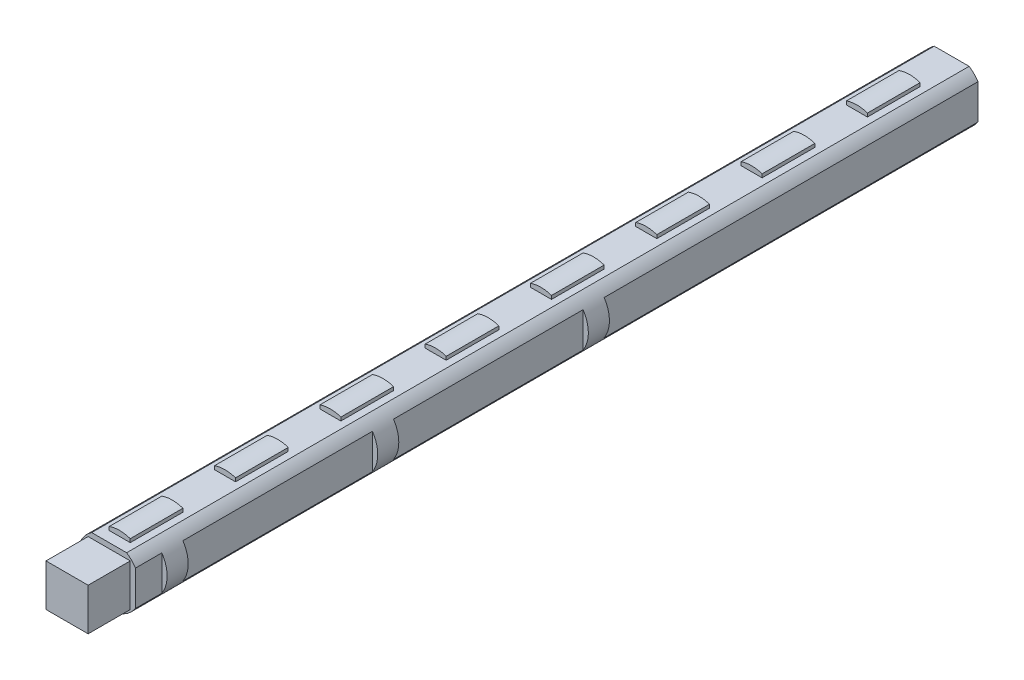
ISO-10303-21;
HEADER;
FILE_DESCRIPTION(('STEP AP214'),'2;1');
FILE_NAME('part.step','',(''),(''),'','','');
FILE_SCHEMA(('AUTOMOTIVE_DESIGN { 1 0 10303 214 1 1 1 1 }'));
ENDSEC;
DATA;
#1=APPLICATION_CONTEXT('core data for automotive mechanical design processes');
#2=APPLICATION_PROTOCOL_DEFINITION('international standard','automotive_design',2000,#1);
#3=PRODUCT_CONTEXT('',#1,'mechanical');
#4=PRODUCT('Part','Part','',(#3));
#5=PRODUCT_RELATED_PRODUCT_CATEGORY('part','',(#4));
#6=PRODUCT_DEFINITION_FORMATION('','',#4);
#7=PRODUCT_DEFINITION_CONTEXT('part definition',#1,'design');
#8=PRODUCT_DEFINITION('design','',#6,#7);
#9=PRODUCT_DEFINITION_SHAPE('','',#8);
#10=(LENGTH_UNIT() NAMED_UNIT(*) SI_UNIT(.MILLI.,.METRE.));
#11=(NAMED_UNIT(*) PLANE_ANGLE_UNIT() SI_UNIT($,.RADIAN.));
#12=(NAMED_UNIT(*) SI_UNIT($,.STERADIAN.) SOLID_ANGLE_UNIT());
#13=UNCERTAINTY_MEASURE_WITH_UNIT(LENGTH_MEASURE(1.E-05),#10,'distance_accuracy_value','');
#14=(GEOMETRIC_REPRESENTATION_CONTEXT(3) GLOBAL_UNCERTAINTY_ASSIGNED_CONTEXT((#13)) GLOBAL_UNIT_ASSIGNED_CONTEXT((#10,
#11,#12)) REPRESENTATION_CONTEXT('',''));
#15=CARTESIAN_POINT('',(0.,0.,0.));
#16=DIRECTION('',(0.,0.,1.));
#17=DIRECTION('',(1.,0.,0.));
#18=AXIS2_PLACEMENT_3D('',#15,#16,#17);
#19=CARTESIAN_POINT('',(-19.05,-19.05,508.));
#20=DIRECTION('',(0.,0.,1.));
#21=DIRECTION('',(1.,0.,0.));
#22=AXIS2_PLACEMENT_3D('',#19,#20,#21);
#23=PLANE('',#22);
#24=DIRECTION('',(0.,-1.,0.));
#25=VECTOR('',#24,1.);
#26=CARTESIAN_POINT('',(-3.175,-38.1,508.));
#27=LINE('',#26,#25);
#28=CARTESIAN_POINT('',(-3.175,-8.51971629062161,508.));
#29=VERTEX_POINT('',#28);
#30=CARTESIAN_POINT('',(-3.175,-29.5802837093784,508.));
#31=VERTEX_POINT('',#30);
#32=EDGE_CURVE('E387',#29,#31,#27,.T.);
#33=ORIENTED_EDGE('',*,*,#32,.F.);
#34=CARTESIAN_POINT('',(-19.05,-19.05,508.));
#35=DIRECTION('',(0.,0.,1.));
#36=DIRECTION('',(1.,0.,0.));
#37=AXIS2_PLACEMENT_3D('',#34,#35,#36);
#38=CIRCLE('',#37,19.05);
#39=CARTESIAN_POINT('',(-8.51971629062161,-3.175,508.));
#40=VERTEX_POINT('',#39);
#41=EDGE_CURVE('E602',#29,#40,#38,.T.);
#42=ORIENTED_EDGE('',*,*,#41,.T.);
#43=DIRECTION('',(1.,0.,0.));
#44=VECTOR('',#43,1.);
#45=CARTESIAN_POINT('',(-38.0999999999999,-3.175,508.));
#46=LINE('',#45,#44);
#47=CARTESIAN_POINT('',(-29.5802837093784,-3.175,508.));
#48=VERTEX_POINT('',#47);
#49=EDGE_CURVE('E582',#48,#40,#46,.T.);
#50=ORIENTED_EDGE('',*,*,#49,.F.);
#51=EDGE_CURVE('E603',#48,#31,#38,.T.);
#52=ORIENTED_EDGE('',*,*,#51,.T.);
#53=EDGE_LOOP('',(#33,#42,#50,#52));
#54=FACE_BOUND('',#53,.T.);
#55=DIRECTION('',(1.,0.,0.));
#56=VECTOR('',#55,1.);
#57=CARTESIAN_POINT('',(-31.75,-31.75,508.));
#58=LINE('',#57,#56);
#59=CARTESIAN_POINT('',(-31.75,-31.75,508.));
#60=VERTEX_POINT('',#59);
#61=CARTESIAN_POINT('',(-6.35,-31.75,508.));
#62=VERTEX_POINT('',#61);
#63=EDGE_CURVE('E329',#60,#62,#58,.T.);
#64=ORIENTED_EDGE('',*,*,#63,.F.);
#65=DIRECTION('',(0.,-1.,0.));
#66=VECTOR('',#65,1.);
#67=CARTESIAN_POINT('',(-31.75,-6.35,508.));
#68=LINE('',#67,#66);
#69=CARTESIAN_POINT('',(-31.75,-6.35,508.));
#70=VERTEX_POINT('',#69);
#71=EDGE_CURVE('E340',#70,#60,#68,.T.);
#72=ORIENTED_EDGE('',*,*,#71,.F.);
#73=DIRECTION('',(-1.,0.,0.));
#74=VECTOR('',#73,1.);
#75=CARTESIAN_POINT('',(-31.75,-6.35,508.));
#76=LINE('',#75,#74);
#77=CARTESIAN_POINT('',(-6.35,-6.35,508.));
#78=VERTEX_POINT('',#77);
#79=EDGE_CURVE('E350',#78,#70,#76,.T.);
#80=ORIENTED_EDGE('',*,*,#79,.F.);
#81=DIRECTION('',(0.,1.,0.));
#82=VECTOR('',#81,1.);
#83=CARTESIAN_POINT('',(-6.35,-6.35,508.));
#84=LINE('',#83,#82);
#85=EDGE_CURVE('E348',#62,#78,#84,.T.);
#86=ORIENTED_EDGE('',*,*,#85,.F.);
#87=EDGE_LOOP('',(#64,#72,#80,#86));
#88=FACE_BOUND('',#87,.T.);
#89=ADVANCED_FACE('F31',(#54,#88),#23,.T.);
#90=CARTESIAN_POINT('',(-19.05,-19.05,508.));
#91=DIRECTION('',(0.,0.,-1.));
#92=DIRECTION('',(-1.,0.,0.));
#93=AXIS2_PLACEMENT_3D('',#90,#91,#92);
#94=CYLINDRICAL_SURFACE('',#93,19.05);
#95=DIRECTION('',(0.,0.,-1.));
#96=VECTOR('',#95,1.);
#97=CARTESIAN_POINT('',(-3.175,-8.51971629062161,508.));
#98=LINE('',#97,#96);
#99=CARTESIAN_POINT('',(-3.175,-8.51971629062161,479.425));
#100=VERTEX_POINT('',#99);
#101=CARTESIAN_POINT('',(-3.175,-8.51971629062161,365.125));
#102=VERTEX_POINT('',#101);
#103=EDGE_CURVE('E710',#100,#102,#98,.T.);
#104=ORIENTED_EDGE('',*,*,#103,.T.);
#105=CARTESIAN_POINT('',(-19.05,-19.05,365.125));
#106=DIRECTION('',(0.,0.,1.));
#107=DIRECTION('',(1.,0.,0.));
#108=AXIS2_PLACEMENT_3D('',#105,#106,#107);
#109=CIRCLE('',#108,19.05);
#110=CARTESIAN_POINT('',(-3.175,-29.5802837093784,365.125));
#111=VERTEX_POINT('',#110);
#112=EDGE_CURVE('E693',#111,#102,#109,.T.);
#113=ORIENTED_EDGE('',*,*,#112,.F.);
#114=DIRECTION('',(0.,0.,-1.));
#115=VECTOR('',#114,1.);
#116=CARTESIAN_POINT('',(-3.175,-29.5802837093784,508.));
#117=LINE('',#116,#115);
#118=CARTESIAN_POINT('',(-3.175,-29.5802837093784,479.425));
#119=VERTEX_POINT('',#118);
#120=EDGE_CURVE('E392',#111,#119,#117,.F.);
#121=ORIENTED_EDGE('',*,*,#120,.T.);
#122=CARTESIAN_POINT('',(-19.05,-19.05,479.425));
#123=DIRECTION('',(0.,0.,-1.));
#124=DIRECTION('',(-1.,0.,0.));
#125=AXIS2_PLACEMENT_3D('',#122,#123,#124);
#126=CIRCLE('',#125,19.05);
#127=EDGE_CURVE('E691',#100,#119,#126,.T.);
#128=ORIENTED_EDGE('',*,*,#127,.F.);
#129=EDGE_LOOP('',(#104,#113,#121,#128));
#130=FACE_BOUND('',#129,.T.);
#131=CARTESIAN_POINT('',(-19.05,-19.05,225.425));
#132=DIRECTION('',(0.,0.,-1.));
#133=DIRECTION('',(-1.,0.,0.));
#134=AXIS2_PLACEMENT_3D('',#131,#132,#133);
#135=CIRCLE('',#134,19.05);
#136=CARTESIAN_POINT('',(-3.175,-8.51971629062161,225.425));
#137=VERTEX_POINT('',#136);
#138=CARTESIAN_POINT('',(-3.175,-29.5802837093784,225.425));
#139=VERTEX_POINT('',#138);
#140=EDGE_CURVE('E11',#137,#139,#135,.T.);
#141=ORIENTED_EDGE('',*,*,#140,.F.);
#142=CARTESIAN_POINT('',(-3.175,-8.51971629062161,0.));
#143=VERTEX_POINT('',#142);
#144=EDGE_CURVE('E394',#137,#143,#98,.T.);
#145=ORIENTED_EDGE('',*,*,#144,.T.);
#146=CARTESIAN_POINT('',(-19.05,-19.05,0.));
#147=DIRECTION('',(0.,0.,1.));
#148=DIRECTION('',(1.,0.,0.));
#149=AXIS2_PLACEMENT_3D('',#146,#147,#148);
#150=CIRCLE('',#149,19.05);
#151=CARTESIAN_POINT('',(-8.51971629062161,-3.175,0.));
#152=VERTEX_POINT('',#151);
#153=EDGE_CURVE('E598',#143,#152,#150,.T.);
#154=ORIENTED_EDGE('',*,*,#153,.T.);
#155=DIRECTION('',(0.,0.,-1.));
#156=VECTOR('',#155,1.);
#157=CARTESIAN_POINT('',(-8.51971629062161,-3.175,508.));
#158=LINE('',#157,#156);
#159=EDGE_CURVE('E595',#40,#152,#158,.T.);
#160=ORIENTED_EDGE('',*,*,#159,.F.);
#161=ORIENTED_EDGE('',*,*,#41,.F.);
#162=CARTESIAN_POINT('',(-3.175,-8.51971629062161,492.125));
#163=VERTEX_POINT('',#162);
#164=EDGE_CURVE('E54',#29,#163,#98,.T.);
#165=ORIENTED_EDGE('',*,*,#164,.T.);
#166=CARTESIAN_POINT('',(-19.05,-19.05,492.125));
#167=DIRECTION('',(0.,0.,1.));
#168=DIRECTION('',(1.,0.,0.));
#169=AXIS2_PLACEMENT_3D('',#166,#167,#168);
#170=CIRCLE('',#169,19.05);
#171=CARTESIAN_POINT('',(-3.175,-29.5802837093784,492.125));
#172=VERTEX_POINT('',#171);
#173=EDGE_CURVE('E695',#172,#163,#170,.T.);
#174=ORIENTED_EDGE('',*,*,#173,.F.);
#175=EDGE_CURVE('E389',#172,#31,#117,.F.);
#176=ORIENTED_EDGE('',*,*,#175,.T.);
#177=ORIENTED_EDGE('',*,*,#51,.F.);
#178=DIRECTION('',(0.,0.,-1.));
#179=VECTOR('',#178,1.);
#180=CARTESIAN_POINT('',(-29.5802837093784,-3.175,508.));
#181=LINE('',#180,#179);
#182=CARTESIAN_POINT('',(-29.5802837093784,-3.175,3.44784378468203E-13));
#183=VERTEX_POINT('',#182);
#184=EDGE_CURVE('E593',#183,#48,#181,.F.);
#185=ORIENTED_EDGE('',*,*,#184,.F.);
#186=CARTESIAN_POINT('',(-3.175,-29.5802837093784,0.));
#187=VERTEX_POINT('',#186);
#188=EDGE_CURVE('E599',#183,#187,#150,.T.);
#189=ORIENTED_EDGE('',*,*,#188,.T.);
#190=EDGE_CURVE('E393',#187,#139,#117,.F.);
#191=ORIENTED_EDGE('',*,*,#190,.T.);
#192=EDGE_LOOP('',(#141,#145,#154,#160,#161,#165,#174,#176,#177,#185,#189,#191));
#193=FACE_BOUND('',#192,.T.);
#194=CARTESIAN_POINT('',(-3.175,-8.51971629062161,352.425));
#195=VERTEX_POINT('',#194);
#196=CARTESIAN_POINT('',(-3.175,-8.51971629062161,238.125));
#197=VERTEX_POINT('',#196);
#198=EDGE_CURVE('E397',#195,#197,#98,.T.);
#199=ORIENTED_EDGE('',*,*,#198,.T.);
#200=CARTESIAN_POINT('',(-19.05,-19.05,238.125));
#201=DIRECTION('',(0.,0.,1.));
#202=DIRECTION('',(1.,0.,0.));
#203=AXIS2_PLACEMENT_3D('',#200,#201,#202);
#204=CIRCLE('',#203,19.05);
#205=CARTESIAN_POINT('',(-3.175,-29.5802837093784,238.125));
#206=VERTEX_POINT('',#205);
#207=EDGE_CURVE('E39',#206,#197,#204,.T.);
#208=ORIENTED_EDGE('',*,*,#207,.F.);
#209=CARTESIAN_POINT('',(-3.175,-29.5802837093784,352.425));
#210=VERTEX_POINT('',#209);
#211=EDGE_CURVE('E709',#206,#210,#117,.F.);
#212=ORIENTED_EDGE('',*,*,#211,.T.);
#213=CARTESIAN_POINT('',(-19.05,-19.05,352.425));
#214=DIRECTION('',(0.,0.,-1.));
#215=DIRECTION('',(-1.,0.,0.));
#216=AXIS2_PLACEMENT_3D('',#213,#214,#215);
#217=CIRCLE('',#216,19.05);
#218=EDGE_CURVE('E697',#195,#210,#217,.T.);
#219=ORIENTED_EDGE('',*,*,#218,.F.);
#220=EDGE_LOOP('',(#199,#208,#212,#219));
#221=FACE_BOUND('',#220,.T.);
#222=ADVANCED_FACE('F33',(#130,#193,#221),#94,.T.);
#223=CARTESIAN_POINT('',(-19.05,-19.05,0.));
#224=DIRECTION('',(0.,0.,1.));
#225=DIRECTION('',(1.,0.,0.));
#226=AXIS2_PLACEMENT_3D('',#223,#224,#225);
#227=PLANE('',#226);
#228=CARTESIAN_POINT('',(-19.05,-19.05,0.));
#229=DIRECTION('',(0.,0.,-1.));
#230=DIRECTION('',(-1.,0.,0.));
#231=AXIS2_PLACEMENT_3D('',#228,#229,#230);
#232=CIRCLE('',#231,6.35);
#233=CARTESIAN_POINT('',(-25.4,-19.05,0.));
#234=VERTEX_POINT('',#233);
#235=EDGE_CURVE('E335',#234,#234,#232,.T.);
#236=ORIENTED_EDGE('',*,*,#235,.F.);
#237=EDGE_LOOP('',(#236));
#238=FACE_BOUND('',#237,.T.);
#239=ORIENTED_EDGE('',*,*,#153,.F.);
#240=DIRECTION('',(0.,-1.,0.));
#241=VECTOR('',#240,1.);
#242=CARTESIAN_POINT('',(-3.175,-19.05,0.));
#243=LINE('',#242,#241);
#244=EDGE_CURVE('E688',#143,#187,#243,.T.);
#245=ORIENTED_EDGE('',*,*,#244,.T.);
#246=ORIENTED_EDGE('',*,*,#188,.F.);
#247=DIRECTION('',(-1.,0.,0.));
#248=VECTOR('',#247,1.);
#249=CARTESIAN_POINT('',(-19.05,-3.175,0.));
#250=LINE('',#249,#248);
#251=EDGE_CURVE('E606',#152,#183,#250,.T.);
#252=ORIENTED_EDGE('',*,*,#251,.F.);
#253=EDGE_LOOP('',(#239,#245,#246,#252));
#254=FACE_BOUND('',#253,.T.);
#255=ADVANCED_FACE('F730',(#238,#254),#227,.F.);
#256=CARTESIAN_POINT('',(-25.4,-3.175,25.4));
#257=DIRECTION('',(-1.,0.,0.));
#258=DIRECTION('',(0.,0.,1.));
#259=AXIS2_PLACEMENT_3D('',#256,#257,#258);
#260=PLANE('',#259);
#261=DIRECTION('',(0.,0.,-1.));
#262=VECTOR('',#261,1.);
#263=CARTESIAN_POINT('',(-25.3999999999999,-1.08948775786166,508.));
#264=LINE('',#263,#262);
#265=CARTESIAN_POINT('',(-25.4,-1.0894877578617,57.15));
#266=VERTEX_POINT('',#265);
#267=CARTESIAN_POINT('',(-25.4,-1.0894877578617,25.4));
#268=VERTEX_POINT('',#267);
#269=EDGE_CURVE('E685',#266,#268,#264,.T.);
#270=ORIENTED_EDGE('',*,*,#269,.T.);
#271=DIRECTION('',(0.,1.,0.));
#272=VECTOR('',#271,1.);
#273=CARTESIAN_POINT('',(-25.4,-3.175,25.4));
#274=LINE('',#273,#272);
#275=CARTESIAN_POINT('',(-25.4,-3.175,25.4));
#276=VERTEX_POINT('',#275);
#277=EDGE_CURVE('E579',#276,#268,#274,.T.);
#278=ORIENTED_EDGE('',*,*,#277,.F.);
#279=DIRECTION('',(0.,0.,1.));
#280=VECTOR('',#279,1.);
#281=CARTESIAN_POINT('',(-25.4,-3.175,25.4));
#282=LINE('',#281,#280);
#283=CARTESIAN_POINT('',(-25.4,-3.175,57.15));
#284=VERTEX_POINT('',#283);
#285=EDGE_CURVE('E558',#276,#284,#282,.T.);
#286=ORIENTED_EDGE('',*,*,#285,.T.);
#287=DIRECTION('',(0.,1.,0.));
#288=VECTOR('',#287,1.);
#289=CARTESIAN_POINT('',(-25.4,-3.175,57.15));
#290=LINE('',#289,#288);
#291=EDGE_CURVE('E578',#284,#266,#290,.T.);
#292=ORIENTED_EDGE('',*,*,#291,.T.);
#293=EDGE_LOOP('',(#270,#278,#286,#292));
#294=FACE_BOUND('',#293,.T.);
#295=ADVANCED_FACE('F758',(#294),#260,.T.);
#296=CARTESIAN_POINT('',(-25.4,-3.175,25.4));
#297=DIRECTION('',(0.,0.,-1.));
#298=DIRECTION('',(-1.,0.,0.));
#299=AXIS2_PLACEMENT_3D('',#296,#297,#298);
#300=PLANE('',#299);
#301=ORIENTED_EDGE('',*,*,#277,.T.);
#302=CARTESIAN_POINT('',(-19.05,-19.05,25.4));
#303=DIRECTION('',(0.,0.,-1.));
#304=DIRECTION('',(-1.,0.,0.));
#305=AXIS2_PLACEMENT_3D('',#302,#303,#304);
#306=CIRCLE('',#305,19.05);
#307=CARTESIAN_POINT('',(-12.7,-1.08948775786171,25.4));
#308=VERTEX_POINT('',#307);
#309=EDGE_CURVE('E683',#268,#308,#306,.T.);
#310=ORIENTED_EDGE('',*,*,#309,.T.);
#311=DIRECTION('',(0.,1.,0.));
#312=VECTOR('',#311,1.);
#313=CARTESIAN_POINT('',(-12.7,-3.175,25.4));
#314=LINE('',#313,#312);
#315=CARTESIAN_POINT('',(-12.7,-3.175,25.4));
#316=VERTEX_POINT('',#315);
#317=EDGE_CURVE('E583',#316,#308,#314,.T.);
#318=ORIENTED_EDGE('',*,*,#317,.F.);
#319=DIRECTION('',(-1.,0.,0.));
#320=VECTOR('',#319,1.);
#321=CARTESIAN_POINT('',(-25.4,-3.175,25.4));
#322=LINE('',#321,#320);
#323=EDGE_CURVE('E575',#316,#276,#322,.T.);
#324=ORIENTED_EDGE('',*,*,#323,.T.);
#325=EDGE_LOOP('',(#301,#310,#318,#324));
#326=FACE_BOUND('',#325,.T.);
#327=ADVANCED_FACE('F766',(#326),#300,.T.);
#328=CARTESIAN_POINT('',(-12.7,-3.175,25.4));
#329=DIRECTION('',(1.,0.,0.));
#330=DIRECTION('',(0.,0.,-1.));
#331=AXIS2_PLACEMENT_3D('',#328,#329,#330);
#332=PLANE('',#331);
#333=DIRECTION('',(0.,0.,-1.));
#334=VECTOR('',#333,1.);
#335=CARTESIAN_POINT('',(-12.7,-1.08948775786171,508.));
#336=LINE('',#335,#334);
#337=CARTESIAN_POINT('',(-12.7,-1.08948775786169,57.15));
#338=VERTEX_POINT('',#337);
#339=EDGE_CURVE('E680',#308,#338,#336,.F.);
#340=ORIENTED_EDGE('',*,*,#339,.T.);
#341=DIRECTION('',(0.,1.,0.));
#342=VECTOR('',#341,1.);
#343=CARTESIAN_POINT('',(-12.7,-3.175,57.15));
#344=LINE('',#343,#342);
#345=CARTESIAN_POINT('',(-12.7,-3.175,57.15));
#346=VERTEX_POINT('',#345);
#347=EDGE_CURVE('E586',#346,#338,#344,.T.);
#348=ORIENTED_EDGE('',*,*,#347,.F.);
#349=DIRECTION('',(0.,0.,-1.));
#350=VECTOR('',#349,1.);
#351=CARTESIAN_POINT('',(-12.7,-3.175,25.4));
#352=LINE('',#351,#350);
#353=EDGE_CURVE('E572',#346,#316,#352,.T.);
#354=ORIENTED_EDGE('',*,*,#353,.T.);
#355=ORIENTED_EDGE('',*,*,#317,.T.);
#356=EDGE_LOOP('',(#340,#348,#354,#355));
#357=FACE_BOUND('',#356,.T.);
#358=ADVANCED_FACE('F772',(#357),#332,.T.);
#359=CARTESIAN_POINT('',(-25.4,-3.175,57.15));
#360=DIRECTION('',(0.,0.,1.));
#361=DIRECTION('',(1.,0.,0.));
#362=AXIS2_PLACEMENT_3D('',#359,#360,#361);
#363=PLANE('',#362);
#364=ORIENTED_EDGE('',*,*,#347,.T.);
#365=CARTESIAN_POINT('',(-19.05,-19.05,57.15));
#366=DIRECTION('',(0.,0.,1.));
#367=DIRECTION('',(1.,0.,0.));
#368=AXIS2_PLACEMENT_3D('',#365,#366,#367);
#369=CIRCLE('',#368,19.05);
#370=EDGE_CURVE('E678',#338,#266,#369,.T.);
#371=ORIENTED_EDGE('',*,*,#370,.T.);
#372=ORIENTED_EDGE('',*,*,#291,.F.);
#373=DIRECTION('',(1.,0.,0.));
#374=VECTOR('',#373,1.);
#375=CARTESIAN_POINT('',(-25.4,-3.175,57.15));
#376=LINE('',#375,#374);
#377=EDGE_CURVE('E569',#284,#346,#376,.T.);
#378=ORIENTED_EDGE('',*,*,#377,.T.);
#379=EDGE_LOOP('',(#364,#371,#372,#378));
#380=FACE_BOUND('',#379,.T.);
#381=ADVANCED_FACE('F768',(#380),#363,.T.);
#382=CARTESIAN_POINT('',(-25.3999999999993,-3.175,88.9));
#383=DIRECTION('',(-1.,0.,0.));
#384=DIRECTION('',(0.,0.,1.));
#385=AXIS2_PLACEMENT_3D('',#382,#383,#384);
#386=PLANE('',#385);
#387=DIRECTION('',(0.,0.,-1.));
#388=VECTOR('',#387,1.);
#389=CARTESIAN_POINT('',(-25.3999999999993,-1.08948775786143,508.));
#390=LINE('',#389,#388);
#391=CARTESIAN_POINT('',(-25.3999999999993,-1.08948775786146,120.65));
#392=VERTEX_POINT('',#391);
#393=CARTESIAN_POINT('',(-25.3999999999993,-1.08948775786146,88.9));
#394=VERTEX_POINT('',#393);
#395=EDGE_CURVE('E675',#392,#394,#390,.T.);
#396=ORIENTED_EDGE('',*,*,#395,.T.);
#397=DIRECTION('',(0.,1.,0.));
#398=VECTOR('',#397,1.);
#399=CARTESIAN_POINT('',(-25.3999999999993,-3.175,88.9));
#400=LINE('',#399,#398);
#401=CARTESIAN_POINT('',(-25.3999999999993,-3.175,88.9));
#402=VERTEX_POINT('',#401);
#403=EDGE_CURVE('E555',#402,#394,#400,.T.);
#404=ORIENTED_EDGE('',*,*,#403,.F.);
#405=DIRECTION('',(0.,0.,1.));
#406=VECTOR('',#405,1.);
#407=CARTESIAN_POINT('',(-25.3999999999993,-3.175,88.9));
#408=LINE('',#407,#406);
#409=CARTESIAN_POINT('',(-25.3999999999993,-3.175,120.65));
#410=VERTEX_POINT('',#409);
#411=EDGE_CURVE('E534',#402,#410,#408,.T.);
#412=ORIENTED_EDGE('',*,*,#411,.T.);
#413=DIRECTION('',(0.,1.,0.));
#414=VECTOR('',#413,1.);
#415=CARTESIAN_POINT('',(-25.3999999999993,-3.175,120.65));
#416=LINE('',#415,#414);
#417=EDGE_CURVE('E554',#410,#392,#416,.T.);
#418=ORIENTED_EDGE('',*,*,#417,.T.);
#419=EDGE_LOOP('',(#396,#404,#412,#418));
#420=FACE_BOUND('',#419,.T.);
#421=ADVANCED_FACE('F771',(#420),#386,.T.);
#422=CARTESIAN_POINT('',(-25.3999999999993,-3.175,88.9));
#423=DIRECTION('',(0.,0.,-1.));
#424=DIRECTION('',(-1.,0.,0.));
#425=AXIS2_PLACEMENT_3D('',#422,#423,#424);
#426=PLANE('',#425);
#427=ORIENTED_EDGE('',*,*,#403,.T.);
#428=CARTESIAN_POINT('',(-19.05,-19.05,88.9));
#429=DIRECTION('',(0.,0.,-1.));
#430=DIRECTION('',(-1.,0.,0.));
#431=AXIS2_PLACEMENT_3D('',#428,#429,#430);
#432=CIRCLE('',#431,19.05);
#433=CARTESIAN_POINT('',(-12.6999999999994,-1.08948775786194,88.9));
#434=VERTEX_POINT('',#433);
#435=EDGE_CURVE('E673',#394,#434,#432,.T.);
#436=ORIENTED_EDGE('',*,*,#435,.T.);
#437=DIRECTION('',(0.,1.,0.));
#438=VECTOR('',#437,1.);
#439=CARTESIAN_POINT('',(-12.6999999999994,-3.175,88.9));
#440=LINE('',#439,#438);
#441=CARTESIAN_POINT('',(-12.6999999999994,-3.175,88.9));
#442=VERTEX_POINT('',#441);
#443=EDGE_CURVE('E559',#442,#434,#440,.T.);
#444=ORIENTED_EDGE('',*,*,#443,.F.);
#445=DIRECTION('',(-1.,0.,0.));
#446=VECTOR('',#445,1.);
#447=CARTESIAN_POINT('',(-25.3999999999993,-3.175,88.9));
#448=LINE('',#447,#446);
#449=EDGE_CURVE('E551',#442,#402,#448,.T.);
#450=ORIENTED_EDGE('',*,*,#449,.T.);
#451=EDGE_LOOP('',(#427,#436,#444,#450));
#452=FACE_BOUND('',#451,.T.);
#453=ADVANCED_FACE('F782',(#452),#426,.T.);
#454=CARTESIAN_POINT('',(-12.6999999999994,-3.175,88.9));
#455=DIRECTION('',(1.,0.,0.));
#456=DIRECTION('',(0.,0.,-1.));
#457=AXIS2_PLACEMENT_3D('',#454,#455,#456);
#458=PLANE('',#457);
#459=DIRECTION('',(0.,0.,-1.));
#460=VECTOR('',#459,1.);
#461=CARTESIAN_POINT('',(-12.6999999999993,-1.08948775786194,508.));
#462=LINE('',#461,#460);
#463=CARTESIAN_POINT('',(-12.6999999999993,-1.08948775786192,120.65));
#464=VERTEX_POINT('',#463);
#465=EDGE_CURVE('E670',#434,#464,#462,.F.);
#466=ORIENTED_EDGE('',*,*,#465,.T.);
#467=DIRECTION('',(0.,1.,0.));
#468=VECTOR('',#467,1.);
#469=CARTESIAN_POINT('',(-12.6999999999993,-3.175,120.65));
#470=LINE('',#469,#468);
#471=CARTESIAN_POINT('',(-12.6999999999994,-3.175,120.65));
#472=VERTEX_POINT('',#471);
#473=EDGE_CURVE('E562',#472,#464,#470,.T.);
#474=ORIENTED_EDGE('',*,*,#473,.F.);
#475=DIRECTION('',(0.,0.,-1.));
#476=VECTOR('',#475,1.);
#477=CARTESIAN_POINT('',(-12.6999999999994,-3.175,88.9));
#478=LINE('',#477,#476);
#479=EDGE_CURVE('E548',#472,#442,#478,.T.);
#480=ORIENTED_EDGE('',*,*,#479,.T.);
#481=ORIENTED_EDGE('',*,*,#443,.T.);
#482=EDGE_LOOP('',(#466,#474,#480,#481));
#483=FACE_BOUND('',#482,.T.);
#484=ADVANCED_FACE('F788',(#483),#458,.T.);
#485=CARTESIAN_POINT('',(-25.3999999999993,-3.175,120.65));
#486=DIRECTION('',(0.,0.,1.));
#487=DIRECTION('',(1.,0.,0.));
#488=AXIS2_PLACEMENT_3D('',#485,#486,#487);
#489=PLANE('',#488);
#490=ORIENTED_EDGE('',*,*,#473,.T.);
#491=CARTESIAN_POINT('',(-19.05,-19.05,120.65));
#492=DIRECTION('',(0.,0.,1.));
#493=DIRECTION('',(1.,0.,0.));
#494=AXIS2_PLACEMENT_3D('',#491,#492,#493);
#495=CIRCLE('',#494,19.05);
#496=EDGE_CURVE('E668',#464,#392,#495,.T.);
#497=ORIENTED_EDGE('',*,*,#496,.T.);
#498=ORIENTED_EDGE('',*,*,#417,.F.);
#499=DIRECTION('',(1.,0.,0.));
#500=VECTOR('',#499,1.);
#501=CARTESIAN_POINT('',(-25.3999999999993,-3.175,120.65));
#502=LINE('',#501,#500);
#503=EDGE_CURVE('E545',#410,#472,#502,.T.);
#504=ORIENTED_EDGE('',*,*,#503,.T.);
#505=EDGE_LOOP('',(#490,#497,#498,#504));
#506=FACE_BOUND('',#505,.T.);
#507=ADVANCED_FACE('F784',(#506),#489,.T.);
#508=CARTESIAN_POINT('',(-25.3999999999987,-3.175,152.4));
#509=DIRECTION('',(-1.,0.,0.));
#510=DIRECTION('',(0.,0.,1.));
#511=AXIS2_PLACEMENT_3D('',#508,#509,#510);
#512=PLANE('',#511);
#513=DIRECTION('',(0.,0.,-1.));
#514=VECTOR('',#513,1.);
#515=CARTESIAN_POINT('',(-25.3999999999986,-1.0894877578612,508.));
#516=LINE('',#515,#514);
#517=CARTESIAN_POINT('',(-25.3999999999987,-1.08948775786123,184.15));
#518=VERTEX_POINT('',#517);
#519=CARTESIAN_POINT('',(-25.3999999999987,-1.08948775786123,152.4));
#520=VERTEX_POINT('',#519);
#521=EDGE_CURVE('E665',#518,#520,#516,.T.);
#522=ORIENTED_EDGE('',*,*,#521,.T.);
#523=DIRECTION('',(0.,1.,0.));
#524=VECTOR('',#523,1.);
#525=CARTESIAN_POINT('',(-25.3999999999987,-3.175,152.4));
#526=LINE('',#525,#524);
#527=CARTESIAN_POINT('',(-25.3999999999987,-3.175,152.4));
#528=VERTEX_POINT('',#527);
#529=EDGE_CURVE('E531',#528,#520,#526,.T.);
#530=ORIENTED_EDGE('',*,*,#529,.F.);
#531=DIRECTION('',(0.,0.,1.));
#532=VECTOR('',#531,1.);
#533=CARTESIAN_POINT('',(-25.3999999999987,-3.175,152.4));
#534=LINE('',#533,#532);
#535=CARTESIAN_POINT('',(-25.3999999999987,-3.175,184.15));
#536=VERTEX_POINT('',#535);
#537=EDGE_CURVE('E510',#528,#536,#534,.T.);
#538=ORIENTED_EDGE('',*,*,#537,.T.);
#539=DIRECTION('',(0.,1.,0.));
#540=VECTOR('',#539,1.);
#541=CARTESIAN_POINT('',(-25.3999999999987,-3.175,184.15));
#542=LINE('',#541,#540);
#543=EDGE_CURVE('E530',#536,#518,#542,.T.);
#544=ORIENTED_EDGE('',*,*,#543,.T.);
#545=EDGE_LOOP('',(#522,#530,#538,#544));
#546=FACE_BOUND('',#545,.T.);
#547=ADVANCED_FACE('F787',(#546),#512,.T.);
#548=CARTESIAN_POINT('',(-25.3999999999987,-3.175,152.4));
#549=DIRECTION('',(0.,0.,-1.));
#550=DIRECTION('',(-1.,0.,0.));
#551=AXIS2_PLACEMENT_3D('',#548,#549,#550);
#552=PLANE('',#551);
#553=ORIENTED_EDGE('',*,*,#529,.T.);
#554=CARTESIAN_POINT('',(-19.05,-19.05,152.4));
#555=DIRECTION('',(0.,0.,-1.));
#556=DIRECTION('',(-1.,0.,0.));
#557=AXIS2_PLACEMENT_3D('',#554,#555,#556);
#558=CIRCLE('',#557,19.05);
#559=CARTESIAN_POINT('',(-12.6999999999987,-1.08948775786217,152.4));
#560=VERTEX_POINT('',#559);
#561=EDGE_CURVE('E663',#520,#560,#558,.T.);
#562=ORIENTED_EDGE('',*,*,#561,.T.);
#563=DIRECTION('',(0.,1.,0.));
#564=VECTOR('',#563,1.);
#565=CARTESIAN_POINT('',(-12.6999999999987,-3.175,152.4));
#566=LINE('',#565,#564);
#567=CARTESIAN_POINT('',(-12.6999999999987,-3.175,152.4));
#568=VERTEX_POINT('',#567);
#569=EDGE_CURVE('E535',#568,#560,#566,.T.);
#570=ORIENTED_EDGE('',*,*,#569,.F.);
#571=DIRECTION('',(-1.,0.,0.));
#572=VECTOR('',#571,1.);
#573=CARTESIAN_POINT('',(-25.3999999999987,-3.175,152.4));
#574=LINE('',#573,#572);
#575=EDGE_CURVE('E527',#568,#528,#574,.T.);
#576=ORIENTED_EDGE('',*,*,#575,.T.);
#577=EDGE_LOOP('',(#553,#562,#570,#576));
#578=FACE_BOUND('',#577,.T.);
#579=ADVANCED_FACE('F798',(#578),#552,.T.);
#580=CARTESIAN_POINT('',(-12.6999999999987,-3.175,152.4));
#581=DIRECTION('',(1.,0.,0.));
#582=DIRECTION('',(0.,0.,-1.));
#583=AXIS2_PLACEMENT_3D('',#580,#581,#582);
#584=PLANE('',#583);
#585=DIRECTION('',(0.,0.,-1.));
#586=VECTOR('',#585,1.);
#587=CARTESIAN_POINT('',(-12.6999999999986,-1.08948775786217,508.));
#588=LINE('',#587,#586);
#589=CARTESIAN_POINT('',(-12.6999999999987,-1.08948775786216,184.15));
#590=VERTEX_POINT('',#589);
#591=EDGE_CURVE('E660',#560,#590,#588,.F.);
#592=ORIENTED_EDGE('',*,*,#591,.T.);
#593=DIRECTION('',(0.,1.,0.));
#594=VECTOR('',#593,1.);
#595=CARTESIAN_POINT('',(-12.6999999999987,-3.175,184.15));
#596=LINE('',#595,#594);
#597=CARTESIAN_POINT('',(-12.6999999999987,-3.175,184.15));
#598=VERTEX_POINT('',#597);
#599=EDGE_CURVE('E538',#598,#590,#596,.T.);
#600=ORIENTED_EDGE('',*,*,#599,.F.);
#601=DIRECTION('',(0.,0.,-1.));
#602=VECTOR('',#601,1.);
#603=CARTESIAN_POINT('',(-12.6999999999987,-3.175,152.4));
#604=LINE('',#603,#602);
#605=EDGE_CURVE('E524',#598,#568,#604,.T.);
#606=ORIENTED_EDGE('',*,*,#605,.T.);
#607=ORIENTED_EDGE('',*,*,#569,.T.);
#608=EDGE_LOOP('',(#592,#600,#606,#607));
#609=FACE_BOUND('',#608,.T.);
#610=ADVANCED_FACE('F804',(#609),#584,.T.);
#611=CARTESIAN_POINT('',(-25.3999999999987,-3.175,184.15));
#612=DIRECTION('',(0.,0.,1.));
#613=DIRECTION('',(1.,0.,0.));
#614=AXIS2_PLACEMENT_3D('',#611,#612,#613);
#615=PLANE('',#614);
#616=ORIENTED_EDGE('',*,*,#599,.T.);
#617=CARTESIAN_POINT('',(-19.05,-19.05,184.15));
#618=DIRECTION('',(0.,0.,1.));
#619=DIRECTION('',(1.,0.,0.));
#620=AXIS2_PLACEMENT_3D('',#617,#618,#619);
#621=CIRCLE('',#620,19.05);
#622=EDGE_CURVE('E658',#590,#518,#621,.T.);
#623=ORIENTED_EDGE('',*,*,#622,.T.);
#624=ORIENTED_EDGE('',*,*,#543,.F.);
#625=DIRECTION('',(1.,0.,0.));
#626=VECTOR('',#625,1.);
#627=CARTESIAN_POINT('',(-25.3999999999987,-3.175,184.15));
#628=LINE('',#627,#626);
#629=EDGE_CURVE('E521',#536,#598,#628,.T.);
#630=ORIENTED_EDGE('',*,*,#629,.T.);
#631=EDGE_LOOP('',(#616,#623,#624,#630));
#632=FACE_BOUND('',#631,.T.);
#633=ADVANCED_FACE('F800',(#632),#615,.T.);
#634=CARTESIAN_POINT('',(-25.399999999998,-3.175,215.9));
#635=DIRECTION('',(-1.,0.,0.));
#636=DIRECTION('',(0.,0.,1.));
#637=AXIS2_PLACEMENT_3D('',#634,#635,#636);
#638=PLANE('',#637);
#639=DIRECTION('',(0.,0.,-1.));
#640=VECTOR('',#639,1.);
#641=CARTESIAN_POINT('',(-25.399999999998,-1.08948775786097,508.));
#642=LINE('',#641,#640);
#643=CARTESIAN_POINT('',(-25.399999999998,-1.08948775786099,247.65));
#644=VERTEX_POINT('',#643);
#645=CARTESIAN_POINT('',(-25.399999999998,-1.08948775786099,215.9));
#646=VERTEX_POINT('',#645);
#647=EDGE_CURVE('E655',#644,#646,#642,.T.);
#648=ORIENTED_EDGE('',*,*,#647,.T.);
#649=DIRECTION('',(0.,1.,0.));
#650=VECTOR('',#649,1.);
#651=CARTESIAN_POINT('',(-25.399999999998,-3.175,215.9));
#652=LINE('',#651,#650);
#653=CARTESIAN_POINT('',(-25.399999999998,-3.175,215.9));
#654=VERTEX_POINT('',#653);
#655=EDGE_CURVE('E507',#654,#646,#652,.T.);
#656=ORIENTED_EDGE('',*,*,#655,.F.);
#657=DIRECTION('',(0.,0.,1.));
#658=VECTOR('',#657,1.);
#659=CARTESIAN_POINT('',(-25.399999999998,-3.175,215.9));
#660=LINE('',#659,#658);
#661=CARTESIAN_POINT('',(-25.399999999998,-3.175,247.65));
#662=VERTEX_POINT('',#661);
#663=EDGE_CURVE('E486',#654,#662,#660,.T.);
#664=ORIENTED_EDGE('',*,*,#663,.T.);
#665=DIRECTION('',(0.,1.,0.));
#666=VECTOR('',#665,1.);
#667=CARTESIAN_POINT('',(-25.399999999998,-3.175,247.65));
#668=LINE('',#667,#666);
#669=EDGE_CURVE('E506',#662,#644,#668,.T.);
#670=ORIENTED_EDGE('',*,*,#669,.T.);
#671=EDGE_LOOP('',(#648,#656,#664,#670));
#672=FACE_BOUND('',#671,.T.);
#673=ADVANCED_FACE('F803',(#672),#638,.T.);
#674=CARTESIAN_POINT('',(-25.399999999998,-3.175,215.9));
#675=DIRECTION('',(0.,0.,-1.));
#676=DIRECTION('',(-1.,0.,0.));
#677=AXIS2_PLACEMENT_3D('',#674,#675,#676);
#678=PLANE('',#677);
#679=ORIENTED_EDGE('',*,*,#655,.T.);
#680=CARTESIAN_POINT('',(-19.05,-19.05,215.9));
#681=DIRECTION('',(0.,0.,-1.));
#682=DIRECTION('',(-1.,0.,0.));
#683=AXIS2_PLACEMENT_3D('',#680,#681,#682);
#684=CIRCLE('',#683,19.05);
#685=CARTESIAN_POINT('',(-12.699999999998,-1.0894877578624,215.9));
#686=VERTEX_POINT('',#685);
#687=EDGE_CURVE('E653',#646,#686,#684,.T.);
#688=ORIENTED_EDGE('',*,*,#687,.T.);
#689=DIRECTION('',(0.,1.,0.));
#690=VECTOR('',#689,1.);
#691=CARTESIAN_POINT('',(-12.699999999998,-3.175,215.9));
#692=LINE('',#691,#690);
#693=CARTESIAN_POINT('',(-12.699999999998,-3.175,215.9));
#694=VERTEX_POINT('',#693);
#695=EDGE_CURVE('E511',#694,#686,#692,.T.);
#696=ORIENTED_EDGE('',*,*,#695,.F.);
#697=DIRECTION('',(-1.,0.,0.));
#698=VECTOR('',#697,1.);
#699=CARTESIAN_POINT('',(-25.399999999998,-3.175,215.9));
#700=LINE('',#699,#698);
#701=EDGE_CURVE('E503',#694,#654,#700,.T.);
#702=ORIENTED_EDGE('',*,*,#701,.T.);
#703=EDGE_LOOP('',(#679,#688,#696,#702));
#704=FACE_BOUND('',#703,.T.);
#705=ADVANCED_FACE('F814',(#704),#678,.T.);
#706=CARTESIAN_POINT('',(-12.699999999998,-3.175,215.9));
#707=DIRECTION('',(1.,0.,0.));
#708=DIRECTION('',(0.,0.,-1.));
#709=AXIS2_PLACEMENT_3D('',#706,#707,#708);
#710=PLANE('',#709);
#711=DIRECTION('',(0.,0.,-1.));
#712=VECTOR('',#711,1.);
#713=CARTESIAN_POINT('',(-12.699999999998,-1.0894877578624,508.));
#714=LINE('',#713,#712);
#715=CARTESIAN_POINT('',(-12.699999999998,-1.08948775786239,247.65));
#716=VERTEX_POINT('',#715);
#717=EDGE_CURVE('E650',#686,#716,#714,.F.);
#718=ORIENTED_EDGE('',*,*,#717,.T.);
#719=DIRECTION('',(0.,1.,0.));
#720=VECTOR('',#719,1.);
#721=CARTESIAN_POINT('',(-12.699999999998,-3.175,247.65));
#722=LINE('',#721,#720);
#723=CARTESIAN_POINT('',(-12.699999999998,-3.175,247.65));
#724=VERTEX_POINT('',#723);
#725=EDGE_CURVE('E514',#724,#716,#722,.T.);
#726=ORIENTED_EDGE('',*,*,#725,.F.);
#727=DIRECTION('',(0.,0.,-1.));
#728=VECTOR('',#727,1.);
#729=CARTESIAN_POINT('',(-12.699999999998,-3.175,215.9));
#730=LINE('',#729,#728);
#731=EDGE_CURVE('E500',#724,#694,#730,.T.);
#732=ORIENTED_EDGE('',*,*,#731,.T.);
#733=ORIENTED_EDGE('',*,*,#695,.T.);
#734=EDGE_LOOP('',(#718,#726,#732,#733));
#735=FACE_BOUND('',#734,.T.);
#736=ADVANCED_FACE('F820',(#735),#710,.T.);
#737=CARTESIAN_POINT('',(-25.399999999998,-3.175,247.65));
#738=DIRECTION('',(0.,0.,1.));
#739=DIRECTION('',(1.,0.,0.));
#740=AXIS2_PLACEMENT_3D('',#737,#738,#739);
#741=PLANE('',#740);
#742=ORIENTED_EDGE('',*,*,#725,.T.);
#743=CARTESIAN_POINT('',(-19.05,-19.05,247.65));
#744=DIRECTION('',(0.,0.,1.));
#745=DIRECTION('',(1.,0.,0.));
#746=AXIS2_PLACEMENT_3D('',#743,#744,#745);
#747=CIRCLE('',#746,19.05);
#748=EDGE_CURVE('E648',#716,#644,#747,.T.);
#749=ORIENTED_EDGE('',*,*,#748,.T.);
#750=ORIENTED_EDGE('',*,*,#669,.F.);
#751=DIRECTION('',(1.,0.,0.));
#752=VECTOR('',#751,1.);
#753=CARTESIAN_POINT('',(-25.399999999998,-3.175,247.65));
#754=LINE('',#753,#752);
#755=EDGE_CURVE('E497',#662,#724,#754,.T.);
#756=ORIENTED_EDGE('',*,*,#755,.T.);
#757=EDGE_LOOP('',(#742,#749,#750,#756));
#758=FACE_BOUND('',#757,.T.);
#759=ADVANCED_FACE('F816',(#758),#741,.T.);
#760=CARTESIAN_POINT('',(-25.3999999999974,-3.175,279.4));
#761=DIRECTION('',(-1.,0.,0.));
#762=DIRECTION('',(0.,0.,1.));
#763=AXIS2_PLACEMENT_3D('',#760,#761,#762);
#764=PLANE('',#763);
#765=DIRECTION('',(0.,0.,-1.));
#766=VECTOR('',#765,1.);
#767=CARTESIAN_POINT('',(-25.3999999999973,-1.08948775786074,508.));
#768=LINE('',#767,#766);
#769=CARTESIAN_POINT('',(-25.3999999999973,-1.08948775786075,311.15));
#770=VERTEX_POINT('',#769);
#771=CARTESIAN_POINT('',(-25.3999999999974,-1.08948775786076,279.4));
#772=VERTEX_POINT('',#771);
#773=EDGE_CURVE('E645',#770,#772,#768,.T.);
#774=ORIENTED_EDGE('',*,*,#773,.T.);
#775=DIRECTION('',(0.,1.,0.));
#776=VECTOR('',#775,1.);
#777=CARTESIAN_POINT('',(-25.3999999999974,-3.175,279.4));
#778=LINE('',#777,#776);
#779=CARTESIAN_POINT('',(-25.3999999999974,-3.175,279.4));
#780=VERTEX_POINT('',#779);
#781=EDGE_CURVE('E483',#780,#772,#778,.T.);
#782=ORIENTED_EDGE('',*,*,#781,.F.);
#783=DIRECTION('',(0.,0.,1.));
#784=VECTOR('',#783,1.);
#785=CARTESIAN_POINT('',(-25.3999999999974,-3.175,279.4));
#786=LINE('',#785,#784);
#787=CARTESIAN_POINT('',(-25.3999999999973,-3.175,311.15));
#788=VERTEX_POINT('',#787);
#789=EDGE_CURVE('E462',#780,#788,#786,.T.);
#790=ORIENTED_EDGE('',*,*,#789,.T.);
#791=DIRECTION('',(0.,1.,0.));
#792=VECTOR('',#791,1.);
#793=CARTESIAN_POINT('',(-25.3999999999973,-3.175,311.15));
#794=LINE('',#793,#792);
#795=EDGE_CURVE('E482',#788,#770,#794,.T.);
#796=ORIENTED_EDGE('',*,*,#795,.T.);
#797=EDGE_LOOP('',(#774,#782,#790,#796));
#798=FACE_BOUND('',#797,.T.);
#799=ADVANCED_FACE('F819',(#798),#764,.T.);
#800=CARTESIAN_POINT('',(-25.3999999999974,-3.175,279.4));
#801=DIRECTION('',(0.,0.,-1.));
#802=DIRECTION('',(-1.,0.,0.));
#803=AXIS2_PLACEMENT_3D('',#800,#801,#802);
#804=PLANE('',#803);
#805=ORIENTED_EDGE('',*,*,#781,.T.);
#806=CARTESIAN_POINT('',(-19.05,-19.05,279.4));
#807=DIRECTION('',(0.,0.,-1.));
#808=DIRECTION('',(-1.,0.,0.));
#809=AXIS2_PLACEMENT_3D('',#806,#807,#808);
#810=CIRCLE('',#809,19.05);
#811=CARTESIAN_POINT('',(-12.6999999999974,-1.08948775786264,279.4));
#812=VERTEX_POINT('',#811);
#813=EDGE_CURVE('E643',#772,#812,#810,.T.);
#814=ORIENTED_EDGE('',*,*,#813,.T.);
#815=DIRECTION('',(0.,1.,0.));
#816=VECTOR('',#815,1.);
#817=CARTESIAN_POINT('',(-12.6999999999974,-3.175,279.4));
#818=LINE('',#817,#816);
#819=CARTESIAN_POINT('',(-12.6999999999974,-3.175,279.4));
#820=VERTEX_POINT('',#819);
#821=EDGE_CURVE('E487',#820,#812,#818,.T.);
#822=ORIENTED_EDGE('',*,*,#821,.F.);
#823=DIRECTION('',(-1.,0.,0.));
#824=VECTOR('',#823,1.);
#825=CARTESIAN_POINT('',(-25.3999999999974,-3.175,279.4));
#826=LINE('',#825,#824);
#827=EDGE_CURVE('E479',#820,#780,#826,.T.);
#828=ORIENTED_EDGE('',*,*,#827,.T.);
#829=EDGE_LOOP('',(#805,#814,#822,#828));
#830=FACE_BOUND('',#829,.T.);
#831=ADVANCED_FACE('F830',(#830),#804,.T.);
#832=CARTESIAN_POINT('',(-12.6999999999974,-3.175,279.4));
#833=DIRECTION('',(1.,0.,0.));
#834=DIRECTION('',(0.,0.,-1.));
#835=AXIS2_PLACEMENT_3D('',#832,#833,#834);
#836=PLANE('',#835);
#837=DIRECTION('',(0.,0.,-1.));
#838=VECTOR('',#837,1.);
#839=CARTESIAN_POINT('',(-12.6999999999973,-1.08948775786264,508.));
#840=LINE('',#839,#838);
#841=CARTESIAN_POINT('',(-12.6999999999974,-1.08948775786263,311.15));
#842=VERTEX_POINT('',#841);
#843=EDGE_CURVE('E640',#812,#842,#840,.F.);
#844=ORIENTED_EDGE('',*,*,#843,.T.);
#845=DIRECTION('',(0.,1.,0.));
#846=VECTOR('',#845,1.);
#847=CARTESIAN_POINT('',(-12.6999999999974,-3.175,311.15));
#848=LINE('',#847,#846);
#849=CARTESIAN_POINT('',(-12.6999999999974,-3.175,311.15));
#850=VERTEX_POINT('',#849);
#851=EDGE_CURVE('E490',#850,#842,#848,.T.);
#852=ORIENTED_EDGE('',*,*,#851,.F.);
#853=DIRECTION('',(0.,0.,-1.));
#854=VECTOR('',#853,1.);
#855=CARTESIAN_POINT('',(-12.6999999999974,-3.175,279.4));
#856=LINE('',#855,#854);
#857=EDGE_CURVE('E476',#850,#820,#856,.T.);
#858=ORIENTED_EDGE('',*,*,#857,.T.);
#859=ORIENTED_EDGE('',*,*,#821,.T.);
#860=EDGE_LOOP('',(#844,#852,#858,#859));
#861=FACE_BOUND('',#860,.T.);
#862=ADVANCED_FACE('F836',(#861),#836,.T.);
#863=CARTESIAN_POINT('',(-25.3999999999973,-3.175,311.15));
#864=DIRECTION('',(0.,0.,1.));
#865=DIRECTION('',(1.,0.,0.));
#866=AXIS2_PLACEMENT_3D('',#863,#864,#865);
#867=PLANE('',#866);
#868=ORIENTED_EDGE('',*,*,#851,.T.);
#869=CARTESIAN_POINT('',(-19.05,-19.05,311.15));
#870=DIRECTION('',(0.,0.,1.));
#871=DIRECTION('',(1.,0.,0.));
#872=AXIS2_PLACEMENT_3D('',#869,#870,#871);
#873=CIRCLE('',#872,19.05);
#874=EDGE_CURVE('E638',#842,#770,#873,.T.);
#875=ORIENTED_EDGE('',*,*,#874,.T.);
#876=ORIENTED_EDGE('',*,*,#795,.F.);
#877=DIRECTION('',(1.,0.,0.));
#878=VECTOR('',#877,1.);
#879=CARTESIAN_POINT('',(-25.3999999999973,-3.175,311.15));
#880=LINE('',#879,#878);
#881=EDGE_CURVE('E473',#788,#850,#880,.T.);
#882=ORIENTED_EDGE('',*,*,#881,.T.);
#883=EDGE_LOOP('',(#868,#875,#876,#882));
#884=FACE_BOUND('',#883,.T.);
#885=ADVANCED_FACE('F832',(#884),#867,.T.);
#886=CARTESIAN_POINT('',(-25.3999999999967,-3.175,342.9));
#887=DIRECTION('',(-1.,0.,0.));
#888=DIRECTION('',(0.,0.,1.));
#889=AXIS2_PLACEMENT_3D('',#886,#887,#888);
#890=PLANE('',#889);
#891=DIRECTION('',(0.,0.,-1.));
#892=VECTOR('',#891,1.);
#893=CARTESIAN_POINT('',(-25.3999999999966,-1.08948775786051,508.));
#894=LINE('',#893,#892);
#895=CARTESIAN_POINT('',(-25.3999999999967,-1.08948775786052,374.65));
#896=VERTEX_POINT('',#895);
#897=CARTESIAN_POINT('',(-25.3999999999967,-1.08948775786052,342.9));
#898=VERTEX_POINT('',#897);
#899=EDGE_CURVE('E635',#896,#898,#894,.T.);
#900=ORIENTED_EDGE('',*,*,#899,.T.);
#901=DIRECTION('',(0.,1.,0.));
#902=VECTOR('',#901,1.);
#903=CARTESIAN_POINT('',(-25.3999999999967,-3.175,342.9));
#904=LINE('',#903,#902);
#905=CARTESIAN_POINT('',(-25.3999999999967,-3.175,342.9));
#906=VERTEX_POINT('',#905);
#907=EDGE_CURVE('E459',#906,#898,#904,.T.);
#908=ORIENTED_EDGE('',*,*,#907,.F.);
#909=DIRECTION('',(0.,0.,1.));
#910=VECTOR('',#909,1.);
#911=CARTESIAN_POINT('',(-25.3999999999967,-3.175,342.9));
#912=LINE('',#911,#910);
#913=CARTESIAN_POINT('',(-25.3999999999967,-3.175,374.65));
#914=VERTEX_POINT('',#913);
#915=EDGE_CURVE('E438',#906,#914,#912,.T.);
#916=ORIENTED_EDGE('',*,*,#915,.T.);
#917=DIRECTION('',(0.,1.,0.));
#918=VECTOR('',#917,1.);
#919=CARTESIAN_POINT('',(-25.3999999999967,-3.175,374.65));
#920=LINE('',#919,#918);
#921=EDGE_CURVE('E458',#914,#896,#920,.T.);
#922=ORIENTED_EDGE('',*,*,#921,.T.);
#923=EDGE_LOOP('',(#900,#908,#916,#922));
#924=FACE_BOUND('',#923,.T.);
#925=ADVANCED_FACE('F835',(#924),#890,.T.);
#926=CARTESIAN_POINT('',(-25.3999999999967,-3.175,342.9));
#927=DIRECTION('',(0.,0.,-1.));
#928=DIRECTION('',(-1.,0.,0.));
#929=AXIS2_PLACEMENT_3D('',#926,#927,#928);
#930=PLANE('',#929);
#931=ORIENTED_EDGE('',*,*,#907,.T.);
#932=CARTESIAN_POINT('',(-19.05,-19.05,342.9));
#933=DIRECTION('',(0.,0.,-1.));
#934=DIRECTION('',(-1.,0.,0.));
#935=AXIS2_PLACEMENT_3D('',#932,#933,#934);
#936=CIRCLE('',#935,19.05);
#937=CARTESIAN_POINT('',(-12.6999999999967,-1.08948775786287,342.9));
#938=VERTEX_POINT('',#937);
#939=EDGE_CURVE('E633',#898,#938,#936,.T.);
#940=ORIENTED_EDGE('',*,*,#939,.T.);
#941=DIRECTION('',(0.,1.,0.));
#942=VECTOR('',#941,1.);
#943=CARTESIAN_POINT('',(-12.6999999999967,-3.175,342.9));
#944=LINE('',#943,#942);
#945=CARTESIAN_POINT('',(-12.6999999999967,-3.175,342.9));
#946=VERTEX_POINT('',#945);
#947=EDGE_CURVE('E463',#946,#938,#944,.T.);
#948=ORIENTED_EDGE('',*,*,#947,.F.);
#949=DIRECTION('',(-1.,0.,0.));
#950=VECTOR('',#949,1.);
#951=CARTESIAN_POINT('',(-25.3999999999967,-3.175,342.9));
#952=LINE('',#951,#950);
#953=EDGE_CURVE('E455',#946,#906,#952,.T.);
#954=ORIENTED_EDGE('',*,*,#953,.T.);
#955=EDGE_LOOP('',(#931,#940,#948,#954));
#956=FACE_BOUND('',#955,.T.);
#957=ADVANCED_FACE('F846',(#956),#930,.T.);
#958=CARTESIAN_POINT('',(-12.6999999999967,-3.175,342.9));
#959=DIRECTION('',(1.,0.,0.));
#960=DIRECTION('',(0.,0.,-1.));
#961=AXIS2_PLACEMENT_3D('',#958,#959,#960);
#962=PLANE('',#961);
#963=DIRECTION('',(0.,0.,-1.));
#964=VECTOR('',#963,1.);
#965=CARTESIAN_POINT('',(-12.6999999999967,-1.08948775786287,508.));
#966=LINE('',#965,#964);
#967=CARTESIAN_POINT('',(-12.6999999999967,-1.08948775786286,374.65));
#968=VERTEX_POINT('',#967);
#969=EDGE_CURVE('E630',#938,#968,#966,.F.);
#970=ORIENTED_EDGE('',*,*,#969,.T.);
#971=DIRECTION('',(0.,1.,0.));
#972=VECTOR('',#971,1.);
#973=CARTESIAN_POINT('',(-12.6999999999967,-3.175,374.65));
#974=LINE('',#973,#972);
#975=CARTESIAN_POINT('',(-12.6999999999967,-3.175,374.65));
#976=VERTEX_POINT('',#975);
#977=EDGE_CURVE('E466',#976,#968,#974,.T.);
#978=ORIENTED_EDGE('',*,*,#977,.F.);
#979=DIRECTION('',(0.,0.,-1.));
#980=VECTOR('',#979,1.);
#981=CARTESIAN_POINT('',(-12.6999999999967,-3.175,342.9));
#982=LINE('',#981,#980);
#983=EDGE_CURVE('E452',#976,#946,#982,.T.);
#984=ORIENTED_EDGE('',*,*,#983,.T.);
#985=ORIENTED_EDGE('',*,*,#947,.T.);
#986=EDGE_LOOP('',(#970,#978,#984,#985));
#987=FACE_BOUND('',#986,.T.);
#988=ADVANCED_FACE('F852',(#987),#962,.T.);
#989=CARTESIAN_POINT('',(-25.3999999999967,-3.175,374.65));
#990=DIRECTION('',(0.,0.,1.));
#991=DIRECTION('',(1.,0.,0.));
#992=AXIS2_PLACEMENT_3D('',#989,#990,#991);
#993=PLANE('',#992);
#994=ORIENTED_EDGE('',*,*,#977,.T.);
#995=CARTESIAN_POINT('',(-19.05,-19.05,374.65));
#996=DIRECTION('',(0.,0.,1.));
#997=DIRECTION('',(1.,0.,0.));
#998=AXIS2_PLACEMENT_3D('',#995,#996,#997);
#999=CIRCLE('',#998,19.05);
#1000=EDGE_CURVE('E628',#968,#896,#999,.T.);
#1001=ORIENTED_EDGE('',*,*,#1000,.T.);
#1002=ORIENTED_EDGE('',*,*,#921,.F.);
#1003=DIRECTION('',(1.,0.,0.));
#1004=VECTOR('',#1003,1.);
#1005=CARTESIAN_POINT('',(-25.3999999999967,-3.175,374.65));
#1006=LINE('',#1005,#1004);
#1007=EDGE_CURVE('E449',#914,#976,#1006,.T.);
#1008=ORIENTED_EDGE('',*,*,#1007,.T.);
#1009=EDGE_LOOP('',(#994,#1001,#1002,#1008));
#1010=FACE_BOUND('',#1009,.T.);
#1011=ADVANCED_FACE('F848',(#1010),#993,.T.);
#1012=CARTESIAN_POINT('',(-25.399999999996,-3.175,406.4));
#1013=DIRECTION('',(-1.,0.,0.));
#1014=DIRECTION('',(0.,0.,1.));
#1015=AXIS2_PLACEMENT_3D('',#1012,#1013,#1014);
#1016=PLANE('',#1015);
#1017=DIRECTION('',(0.,0.,-1.));
#1018=VECTOR('',#1017,1.);
#1019=CARTESIAN_POINT('',(-25.399999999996,-1.08948775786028,508.));
#1020=LINE('',#1019,#1018);
#1021=CARTESIAN_POINT('',(-25.399999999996,-1.08948775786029,438.15));
#1022=VERTEX_POINT('',#1021);
#1023=CARTESIAN_POINT('',(-25.399999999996,-1.08948775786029,406.4));
#1024=VERTEX_POINT('',#1023);
#1025=EDGE_CURVE('E625',#1022,#1024,#1020,.T.);
#1026=ORIENTED_EDGE('',*,*,#1025,.T.);
#1027=DIRECTION('',(0.,1.,0.));
#1028=VECTOR('',#1027,1.);
#1029=CARTESIAN_POINT('',(-25.399999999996,-3.175,406.4));
#1030=LINE('',#1029,#1028);
#1031=CARTESIAN_POINT('',(-25.399999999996,-3.175,406.4));
#1032=VERTEX_POINT('',#1031);
#1033=EDGE_CURVE('E435',#1032,#1024,#1030,.T.);
#1034=ORIENTED_EDGE('',*,*,#1033,.F.);
#1035=DIRECTION('',(0.,0.,1.));
#1036=VECTOR('',#1035,1.);
#1037=CARTESIAN_POINT('',(-25.399999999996,-3.175,406.4));
#1038=LINE('',#1037,#1036);
#1039=CARTESIAN_POINT('',(-25.399999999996,-3.175,438.15));
#1040=VERTEX_POINT('',#1039);
#1041=EDGE_CURVE('E414',#1032,#1040,#1038,.T.);
#1042=ORIENTED_EDGE('',*,*,#1041,.T.);
#1043=DIRECTION('',(0.,1.,0.));
#1044=VECTOR('',#1043,1.);
#1045=CARTESIAN_POINT('',(-25.399999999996,-3.175,438.15));
#1046=LINE('',#1045,#1044);
#1047=EDGE_CURVE('E434',#1040,#1022,#1046,.T.);
#1048=ORIENTED_EDGE('',*,*,#1047,.T.);
#1049=EDGE_LOOP('',(#1026,#1034,#1042,#1048));
#1050=FACE_BOUND('',#1049,.T.);
#1051=ADVANCED_FACE('F851',(#1050),#1016,.T.);
#1052=CARTESIAN_POINT('',(-25.399999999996,-3.175,406.4));
#1053=DIRECTION('',(0.,0.,-1.));
#1054=DIRECTION('',(-1.,0.,0.));
#1055=AXIS2_PLACEMENT_3D('',#1052,#1053,#1054);
#1056=PLANE('',#1055);
#1057=ORIENTED_EDGE('',*,*,#1033,.T.);
#1058=CARTESIAN_POINT('',(-19.05,-19.05,406.4));
#1059=DIRECTION('',(0.,0.,-1.));
#1060=DIRECTION('',(-1.,0.,0.));
#1061=AXIS2_PLACEMENT_3D('',#1058,#1059,#1060);
#1062=CIRCLE('',#1061,19.05);
#1063=CARTESIAN_POINT('',(-12.699999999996,-1.0894877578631,406.4));
#1064=VERTEX_POINT('',#1063);
#1065=EDGE_CURVE('E623',#1024,#1064,#1062,.T.);
#1066=ORIENTED_EDGE('',*,*,#1065,.T.);
#1067=DIRECTION('',(0.,1.,0.));
#1068=VECTOR('',#1067,1.);
#1069=CARTESIAN_POINT('',(-12.699999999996,-3.175,406.4));
#1070=LINE('',#1069,#1068);
#1071=CARTESIAN_POINT('',(-12.699999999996,-3.175,406.4));
#1072=VERTEX_POINT('',#1071);
#1073=EDGE_CURVE('E439',#1072,#1064,#1070,.T.);
#1074=ORIENTED_EDGE('',*,*,#1073,.F.);
#1075=DIRECTION('',(-1.,0.,0.));
#1076=VECTOR('',#1075,1.);
#1077=CARTESIAN_POINT('',(-25.399999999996,-3.175,406.4));
#1078=LINE('',#1077,#1076);
#1079=EDGE_CURVE('E431',#1072,#1032,#1078,.T.);
#1080=ORIENTED_EDGE('',*,*,#1079,.T.);
#1081=EDGE_LOOP('',(#1057,#1066,#1074,#1080));
#1082=FACE_BOUND('',#1081,.T.);
#1083=ADVANCED_FACE('F862',(#1082),#1056,.T.);
#1084=CARTESIAN_POINT('',(-12.699999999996,-3.175,406.4));
#1085=DIRECTION('',(1.,0.,0.));
#1086=DIRECTION('',(0.,0.,-1.));
#1087=AXIS2_PLACEMENT_3D('',#1084,#1085,#1086);
#1088=PLANE('',#1087);
#1089=DIRECTION('',(0.,0.,-1.));
#1090=VECTOR('',#1089,1.);
#1091=CARTESIAN_POINT('',(-12.699999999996,-1.0894877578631,508.));
#1092=LINE('',#1091,#1090);
#1093=CARTESIAN_POINT('',(-12.699999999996,-1.0894877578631,438.15));
#1094=VERTEX_POINT('',#1093);
#1095=EDGE_CURVE('E620',#1064,#1094,#1092,.F.);
#1096=ORIENTED_EDGE('',*,*,#1095,.T.);
#1097=DIRECTION('',(0.,1.,0.));
#1098=VECTOR('',#1097,1.);
#1099=CARTESIAN_POINT('',(-12.699999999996,-3.175,438.15));
#1100=LINE('',#1099,#1098);
#1101=CARTESIAN_POINT('',(-12.699999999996,-3.175,438.15));
#1102=VERTEX_POINT('',#1101);
#1103=EDGE_CURVE('E442',#1102,#1094,#1100,.T.);
#1104=ORIENTED_EDGE('',*,*,#1103,.F.);
#1105=DIRECTION('',(0.,0.,-1.));
#1106=VECTOR('',#1105,1.);
#1107=CARTESIAN_POINT('',(-12.699999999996,-3.175,406.4));
#1108=LINE('',#1107,#1106);
#1109=EDGE_CURVE('E428',#1102,#1072,#1108,.T.);
#1110=ORIENTED_EDGE('',*,*,#1109,.T.);
#1111=ORIENTED_EDGE('',*,*,#1073,.T.);
#1112=EDGE_LOOP('',(#1096,#1104,#1110,#1111));
#1113=FACE_BOUND('',#1112,.T.);
#1114=ADVANCED_FACE('F868',(#1113),#1088,.T.);
#1115=CARTESIAN_POINT('',(-25.399999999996,-3.175,438.15));
#1116=DIRECTION('',(0.,0.,1.));
#1117=DIRECTION('',(1.,0.,0.));
#1118=AXIS2_PLACEMENT_3D('',#1115,#1116,#1117);
#1119=PLANE('',#1118);
#1120=ORIENTED_EDGE('',*,*,#1103,.T.);
#1121=CARTESIAN_POINT('',(-19.05,-19.05,438.15));
#1122=DIRECTION('',(0.,0.,1.));
#1123=DIRECTION('',(1.,0.,0.));
#1124=AXIS2_PLACEMENT_3D('',#1121,#1122,#1123);
#1125=CIRCLE('',#1124,19.05);
#1126=EDGE_CURVE('E618',#1094,#1022,#1125,.T.);
#1127=ORIENTED_EDGE('',*,*,#1126,.T.);
#1128=ORIENTED_EDGE('',*,*,#1047,.F.);
#1129=DIRECTION('',(1.,0.,0.));
#1130=VECTOR('',#1129,1.);
#1131=CARTESIAN_POINT('',(-25.399999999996,-3.175,438.15));
#1132=LINE('',#1131,#1130);
#1133=EDGE_CURVE('E425',#1040,#1102,#1132,.T.);
#1134=ORIENTED_EDGE('',*,*,#1133,.T.);
#1135=EDGE_LOOP('',(#1120,#1127,#1128,#1134));
#1136=FACE_BOUND('',#1135,.T.);
#1137=ADVANCED_FACE('F864',(#1136),#1119,.T.);
#1138=CARTESIAN_POINT('',(-25.3999999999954,-3.175,469.9));
#1139=DIRECTION('',(-1.,0.,0.));
#1140=DIRECTION('',(0.,0.,1.));
#1141=AXIS2_PLACEMENT_3D('',#1138,#1139,#1140);
#1142=PLANE('',#1141);
#1143=DIRECTION('',(0.,0.,-1.));
#1144=VECTOR('',#1143,1.);
#1145=CARTESIAN_POINT('',(-25.3999999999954,-1.08948775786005,508.));
#1146=LINE('',#1145,#1144);
#1147=CARTESIAN_POINT('',(-25.3999999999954,-1.08948775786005,501.65));
#1148=VERTEX_POINT('',#1147);
#1149=CARTESIAN_POINT('',(-25.3999999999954,-1.08948775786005,469.9));
#1150=VERTEX_POINT('',#1149);
#1151=EDGE_CURVE('E615',#1148,#1150,#1146,.T.);
#1152=ORIENTED_EDGE('',*,*,#1151,.T.);
#1153=DIRECTION('',(0.,1.,0.));
#1154=VECTOR('',#1153,1.);
#1155=CARTESIAN_POINT('',(-25.3999999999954,-3.175,469.9));
#1156=LINE('',#1155,#1154);
#1157=CARTESIAN_POINT('',(-25.3999999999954,-3.175,469.9));
#1158=VERTEX_POINT('',#1157);
#1159=EDGE_CURVE('E411',#1158,#1150,#1156,.T.);
#1160=ORIENTED_EDGE('',*,*,#1159,.F.);
#1161=DIRECTION('',(0.,0.,1.));
#1162=VECTOR('',#1161,1.);
#1163=CARTESIAN_POINT('',(-25.3999999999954,-3.175,469.9));
#1164=LINE('',#1163,#1162);
#1165=CARTESIAN_POINT('',(-25.3999999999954,-3.175,501.65));
#1166=VERTEX_POINT('',#1165);
#1167=EDGE_CURVE('E398',#1158,#1166,#1164,.T.);
#1168=ORIENTED_EDGE('',*,*,#1167,.T.);
#1169=DIRECTION('',(0.,1.,0.));
#1170=VECTOR('',#1169,1.);
#1171=CARTESIAN_POINT('',(-25.3999999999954,-3.175,501.65));
#1172=LINE('',#1171,#1170);
#1173=EDGE_CURVE('E410',#1166,#1148,#1172,.T.);
#1174=ORIENTED_EDGE('',*,*,#1173,.T.);
#1175=EDGE_LOOP('',(#1152,#1160,#1168,#1174));
#1176=FACE_BOUND('',#1175,.T.);
#1177=ADVANCED_FACE('F867',(#1176),#1142,.T.);
#1178=CARTESIAN_POINT('',(-25.3999999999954,-3.175,469.9));
#1179=DIRECTION('',(0.,0.,-1.));
#1180=DIRECTION('',(-1.,0.,0.));
#1181=AXIS2_PLACEMENT_3D('',#1178,#1179,#1180);
#1182=PLANE('',#1181);
#1183=ORIENTED_EDGE('',*,*,#1159,.T.);
#1184=CARTESIAN_POINT('',(-19.05,-19.05,469.9));
#1185=DIRECTION('',(0.,0.,-1.));
#1186=DIRECTION('',(-1.,0.,0.));
#1187=AXIS2_PLACEMENT_3D('',#1184,#1185,#1186);
#1188=CIRCLE('',#1187,19.05);
#1189=CARTESIAN_POINT('',(-12.6999999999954,-1.08948775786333,469.9));
#1190=VERTEX_POINT('',#1189);
#1191=EDGE_CURVE('E613',#1150,#1190,#1188,.T.);
#1192=ORIENTED_EDGE('',*,*,#1191,.T.);
#1193=DIRECTION('',(0.,1.,0.));
#1194=VECTOR('',#1193,1.);
#1195=CARTESIAN_POINT('',(-12.6999999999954,-3.175,469.9));
#1196=LINE('',#1195,#1194);
#1197=CARTESIAN_POINT('',(-12.6999999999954,-3.175,469.9));
#1198=VERTEX_POINT('',#1197);
#1199=EDGE_CURVE('E415',#1198,#1190,#1196,.T.);
#1200=ORIENTED_EDGE('',*,*,#1199,.F.);
#1201=DIRECTION('',(-1.,0.,0.));
#1202=VECTOR('',#1201,1.);
#1203=CARTESIAN_POINT('',(-25.3999999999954,-3.175,469.9));
#1204=LINE('',#1203,#1202);
#1205=EDGE_CURVE('E407',#1198,#1158,#1204,.T.);
#1206=ORIENTED_EDGE('',*,*,#1205,.T.);
#1207=EDGE_LOOP('',(#1183,#1192,#1200,#1206));
#1208=FACE_BOUND('',#1207,.T.);
#1209=ADVANCED_FACE('F878',(#1208),#1182,.T.);
#1210=CARTESIAN_POINT('',(-12.6999999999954,-3.175,469.9));
#1211=DIRECTION('',(1.,0.,0.));
#1212=DIRECTION('',(0.,0.,-1.));
#1213=AXIS2_PLACEMENT_3D('',#1210,#1211,#1212);
#1214=PLANE('',#1213);
#1215=DIRECTION('',(0.,0.,-1.));
#1216=VECTOR('',#1215,1.);
#1217=CARTESIAN_POINT('',(-12.6999999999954,-1.08948775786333,508.));
#1218=LINE('',#1217,#1216);
#1219=CARTESIAN_POINT('',(-12.6999999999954,-1.08948775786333,501.65));
#1220=VERTEX_POINT('',#1219);
#1221=EDGE_CURVE('E610',#1190,#1220,#1218,.F.);
#1222=ORIENTED_EDGE('',*,*,#1221,.T.);
#1223=DIRECTION('',(0.,1.,0.));
#1224=VECTOR('',#1223,1.);
#1225=CARTESIAN_POINT('',(-12.6999999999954,-3.175,501.65));
#1226=LINE('',#1225,#1224);
#1227=CARTESIAN_POINT('',(-12.6999999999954,-3.175,501.65));
#1228=VERTEX_POINT('',#1227);
#1229=EDGE_CURVE('E418',#1228,#1220,#1226,.T.);
#1230=ORIENTED_EDGE('',*,*,#1229,.F.);
#1231=DIRECTION('',(0.,0.,-1.));
#1232=VECTOR('',#1231,1.);
#1233=CARTESIAN_POINT('',(-12.6999999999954,-3.175,469.9));
#1234=LINE('',#1233,#1232);
#1235=EDGE_CURVE('E404',#1228,#1198,#1234,.T.);
#1236=ORIENTED_EDGE('',*,*,#1235,.T.);
#1237=ORIENTED_EDGE('',*,*,#1199,.T.);
#1238=EDGE_LOOP('',(#1222,#1230,#1236,#1237));
#1239=FACE_BOUND('',#1238,.T.);
#1240=ADVANCED_FACE('F882',(#1239),#1214,.T.);
#1241=CARTESIAN_POINT('',(-25.3999999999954,-3.175,501.65));
#1242=DIRECTION('',(0.,0.,1.));
#1243=DIRECTION('',(1.,0.,0.));
#1244=AXIS2_PLACEMENT_3D('',#1241,#1242,#1243);
#1245=PLANE('',#1244);
#1246=ORIENTED_EDGE('',*,*,#1229,.T.);
#1247=CARTESIAN_POINT('',(-19.05,-19.05,501.65));
#1248=DIRECTION('',(0.,0.,1.));
#1249=DIRECTION('',(1.,0.,0.));
#1250=AXIS2_PLACEMENT_3D('',#1247,#1248,#1249);
#1251=CIRCLE('',#1250,19.05);
#1252=EDGE_CURVE('E608',#1220,#1148,#1251,.T.);
#1253=ORIENTED_EDGE('',*,*,#1252,.T.);
#1254=ORIENTED_EDGE('',*,*,#1173,.F.);
#1255=DIRECTION('',(1.,0.,0.));
#1256=VECTOR('',#1255,1.);
#1257=CARTESIAN_POINT('',(-25.3999999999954,-3.175,501.65));
#1258=LINE('',#1257,#1256);
#1259=EDGE_CURVE('E401',#1166,#1228,#1258,.T.);
#1260=ORIENTED_EDGE('',*,*,#1259,.T.);
#1261=EDGE_LOOP('',(#1246,#1253,#1254,#1260));
#1262=FACE_BOUND('',#1261,.T.);
#1263=ADVANCED_FACE('F762',(#1262),#1245,.T.);
#1264=CARTESIAN_POINT('',(-38.0999999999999,-3.175,508.));
#1265=DIRECTION('',(0.,1.,0.));
#1266=DIRECTION('',(0.,0.,1.));
#1267=AXIS2_PLACEMENT_3D('',#1264,#1265,#1266);
#1268=PLANE('',#1267);
#1269=ORIENTED_EDGE('',*,*,#1205,.F.);
#1270=ORIENTED_EDGE('',*,*,#1235,.F.);
#1271=ORIENTED_EDGE('',*,*,#1259,.F.);
#1272=ORIENTED_EDGE('',*,*,#1167,.F.);
#1273=EDGE_LOOP('',(#1269,#1270,#1271,#1272));
#1274=FACE_BOUND('',#1273,.T.);
#1275=ORIENTED_EDGE('',*,*,#1079,.F.);
#1276=ORIENTED_EDGE('',*,*,#1109,.F.);
#1277=ORIENTED_EDGE('',*,*,#1133,.F.);
#1278=ORIENTED_EDGE('',*,*,#1041,.F.);
#1279=EDGE_LOOP('',(#1275,#1276,#1277,#1278));
#1280=FACE_BOUND('',#1279,.T.);
#1281=ORIENTED_EDGE('',*,*,#953,.F.);
#1282=ORIENTED_EDGE('',*,*,#983,.F.);
#1283=ORIENTED_EDGE('',*,*,#1007,.F.);
#1284=ORIENTED_EDGE('',*,*,#915,.F.);
#1285=EDGE_LOOP('',(#1281,#1282,#1283,#1284));
#1286=FACE_BOUND('',#1285,.T.);
#1287=ORIENTED_EDGE('',*,*,#827,.F.);
#1288=ORIENTED_EDGE('',*,*,#857,.F.);
#1289=ORIENTED_EDGE('',*,*,#881,.F.);
#1290=ORIENTED_EDGE('',*,*,#789,.F.);
#1291=EDGE_LOOP('',(#1287,#1288,#1289,#1290));
#1292=FACE_BOUND('',#1291,.T.);
#1293=ORIENTED_EDGE('',*,*,#701,.F.);
#1294=ORIENTED_EDGE('',*,*,#731,.F.);
#1295=ORIENTED_EDGE('',*,*,#755,.F.);
#1296=ORIENTED_EDGE('',*,*,#663,.F.);
#1297=EDGE_LOOP('',(#1293,#1294,#1295,#1296));
#1298=FACE_BOUND('',#1297,.T.);
#1299=ORIENTED_EDGE('',*,*,#575,.F.);
#1300=ORIENTED_EDGE('',*,*,#605,.F.);
#1301=ORIENTED_EDGE('',*,*,#629,.F.);
#1302=ORIENTED_EDGE('',*,*,#537,.F.);
#1303=EDGE_LOOP('',(#1299,#1300,#1301,#1302));
#1304=FACE_BOUND('',#1303,.T.);
#1305=ORIENTED_EDGE('',*,*,#449,.F.);
#1306=ORIENTED_EDGE('',*,*,#479,.F.);
#1307=ORIENTED_EDGE('',*,*,#503,.F.);
#1308=ORIENTED_EDGE('',*,*,#411,.F.);
#1309=EDGE_LOOP('',(#1305,#1306,#1307,#1308));
#1310=FACE_BOUND('',#1309,.T.);
#1311=ORIENTED_EDGE('',*,*,#323,.F.);
#1312=ORIENTED_EDGE('',*,*,#353,.F.);
#1313=ORIENTED_EDGE('',*,*,#377,.F.);
#1314=ORIENTED_EDGE('',*,*,#285,.F.);
#1315=EDGE_LOOP('',(#1311,#1312,#1313,#1314));
#1316=FACE_BOUND('',#1315,.T.);
#1317=ORIENTED_EDGE('',*,*,#159,.T.);
#1318=ORIENTED_EDGE('',*,*,#251,.T.);
#1319=ORIENTED_EDGE('',*,*,#184,.T.);
#1320=ORIENTED_EDGE('',*,*,#49,.T.);
#1321=EDGE_LOOP('',(#1317,#1318,#1319,#1320));
#1322=FACE_BOUND('',#1321,.T.);
#1323=ADVANCED_FACE('F723',(#1274,#1280,#1286,#1292,#1298,#1304,#1310,#1316,#1322),#1268,.T.);
#1324=ORIENTED_EDGE('',*,*,#1151,.F.);
#1325=ORIENTED_EDGE('',*,*,#1252,.F.);
#1326=ORIENTED_EDGE('',*,*,#1221,.F.);
#1327=ORIENTED_EDGE('',*,*,#1191,.F.);
#1328=EDGE_LOOP('',(#1324,#1325,#1326,#1327));
#1329=FACE_BOUND('',#1328,.T.);
#1330=ADVANCED_FACE('F754',(#1329),#94,.T.);
#1331=ORIENTED_EDGE('',*,*,#1025,.F.);
#1332=ORIENTED_EDGE('',*,*,#1126,.F.);
#1333=ORIENTED_EDGE('',*,*,#1095,.F.);
#1334=ORIENTED_EDGE('',*,*,#1065,.F.);
#1335=EDGE_LOOP('',(#1331,#1332,#1333,#1334));
#1336=FACE_BOUND('',#1335,.T.);
#1337=ADVANCED_FACE('F1163',(#1336),#94,.T.);
#1338=ORIENTED_EDGE('',*,*,#899,.F.);
#1339=ORIENTED_EDGE('',*,*,#1000,.F.);
#1340=ORIENTED_EDGE('',*,*,#969,.F.);
#1341=ORIENTED_EDGE('',*,*,#939,.F.);
#1342=EDGE_LOOP('',(#1338,#1339,#1340,#1341));
#1343=FACE_BOUND('',#1342,.T.);
#1344=ADVANCED_FACE('F1169',(#1343),#94,.T.);
#1345=ORIENTED_EDGE('',*,*,#773,.F.);
#1346=ORIENTED_EDGE('',*,*,#874,.F.);
#1347=ORIENTED_EDGE('',*,*,#843,.F.);
#1348=ORIENTED_EDGE('',*,*,#813,.F.);
#1349=EDGE_LOOP('',(#1345,#1346,#1347,#1348));
#1350=FACE_BOUND('',#1349,.T.);
#1351=ADVANCED_FACE('F1176',(#1350),#94,.T.);
#1352=ORIENTED_EDGE('',*,*,#647,.F.);
#1353=ORIENTED_EDGE('',*,*,#748,.F.);
#1354=ORIENTED_EDGE('',*,*,#717,.F.);
#1355=ORIENTED_EDGE('',*,*,#687,.F.);
#1356=EDGE_LOOP('',(#1352,#1353,#1354,#1355));
#1357=FACE_BOUND('',#1356,.T.);
#1358=ADVANCED_FACE('F1183',(#1357),#94,.T.);
#1359=ORIENTED_EDGE('',*,*,#521,.F.);
#1360=ORIENTED_EDGE('',*,*,#622,.F.);
#1361=ORIENTED_EDGE('',*,*,#591,.F.);
#1362=ORIENTED_EDGE('',*,*,#561,.F.);
#1363=EDGE_LOOP('',(#1359,#1360,#1361,#1362));
#1364=FACE_BOUND('',#1363,.T.);
#1365=ADVANCED_FACE('F1190',(#1364),#94,.T.);
#1366=ORIENTED_EDGE('',*,*,#395,.F.);
#1367=ORIENTED_EDGE('',*,*,#496,.F.);
#1368=ORIENTED_EDGE('',*,*,#465,.F.);
#1369=ORIENTED_EDGE('',*,*,#435,.F.);
#1370=EDGE_LOOP('',(#1366,#1367,#1368,#1369));
#1371=FACE_BOUND('',#1370,.T.);
#1372=ADVANCED_FACE('F1197',(#1371),#94,.T.);
#1373=ORIENTED_EDGE('',*,*,#269,.F.);
#1374=ORIENTED_EDGE('',*,*,#370,.F.);
#1375=ORIENTED_EDGE('',*,*,#339,.F.);
#1376=ORIENTED_EDGE('',*,*,#309,.F.);
#1377=EDGE_LOOP('',(#1373,#1374,#1375,#1376));
#1378=FACE_BOUND('',#1377,.T.);
#1379=ADVANCED_FACE('F747',(#1378),#94,.T.);
#1380=CARTESIAN_POINT('',(-3.175,0.,508.));
#1381=DIRECTION('',(-1.,0.,0.));
#1382=DIRECTION('',(0.,0.,1.));
#1383=AXIS2_PLACEMENT_3D('',#1380,#1381,#1382);
#1384=PLANE('',#1383);
#1385=DIRECTION('',(0.,1.,0.));
#1386=VECTOR('',#1385,1.);
#1387=CARTESIAN_POINT('',(-3.175,-3.17499999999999,225.425));
#1388=LINE('',#1387,#1386);
#1389=EDGE_CURVE('E384',#139,#137,#1388,.T.);
#1390=ORIENTED_EDGE('',*,*,#1389,.F.);
#1391=ORIENTED_EDGE('',*,*,#190,.F.);
#1392=ORIENTED_EDGE('',*,*,#244,.F.);
#1393=ORIENTED_EDGE('',*,*,#144,.F.);
#1394=EDGE_LOOP('',(#1390,#1391,#1392,#1393));
#1395=FACE_BOUND('',#1394,.T.);
#1396=ADVANCED_FACE('F734',(#1395),#1384,.F.);
#1397=CARTESIAN_POINT('',(-3.175,-3.17499999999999,225.425));
#1398=DIRECTION('',(0.,0.,-1.));
#1399=DIRECTION('',(-1.,0.,0.));
#1400=AXIS2_PLACEMENT_3D('',#1397,#1398,#1399);
#1401=PLANE('',#1400);
#1402=ORIENTED_EDGE('',*,*,#1389,.T.);
#1403=ORIENTED_EDGE('',*,*,#140,.T.);
#1404=EDGE_LOOP('',(#1402,#1403));
#1405=FACE_BOUND('',#1404,.T.);
#1406=ADVANCED_FACE('F736',(#1405),#1401,.T.);
#1407=ORIENTED_EDGE('',*,*,#32,.T.);
#1408=ORIENTED_EDGE('',*,*,#175,.F.);
#1409=DIRECTION('',(0.,-1.,0.));
#1410=VECTOR('',#1409,1.);
#1411=CARTESIAN_POINT('',(-3.175,-3.17500000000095,492.125));
#1412=LINE('',#1411,#1410);
#1413=EDGE_CURVE('E369',#163,#172,#1412,.T.);
#1414=ORIENTED_EDGE('',*,*,#1413,.F.);
#1415=ORIENTED_EDGE('',*,*,#164,.F.);
#1416=EDGE_LOOP('',(#1407,#1408,#1414,#1415));
#1417=FACE_BOUND('',#1416,.T.);
#1418=ADVANCED_FACE('F738',(#1417),#1384,.F.);
#1419=CARTESIAN_POINT('',(-3.175,-3.17500000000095,492.125));
#1420=DIRECTION('',(0.,0.,1.));
#1421=DIRECTION('',(1.,0.,0.));
#1422=AXIS2_PLACEMENT_3D('',#1419,#1420,#1421);
#1423=PLANE('',#1422);
#1424=ORIENTED_EDGE('',*,*,#173,.T.);
#1425=ORIENTED_EDGE('',*,*,#1413,.T.);
#1426=EDGE_LOOP('',(#1424,#1425));
#1427=FACE_BOUND('',#1426,.T.);
#1428=ADVANCED_FACE('F744',(#1427),#1423,.T.);
#1429=CARTESIAN_POINT('',(-3.175,-3.17500000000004,365.125));
#1430=DIRECTION('',(0.,0.,1.));
#1431=DIRECTION('',(1.,0.,0.));
#1432=AXIS2_PLACEMENT_3D('',#1429,#1430,#1431);
#1433=PLANE('',#1432);
#1434=ORIENTED_EDGE('',*,*,#112,.T.);
#1435=DIRECTION('',(0.,-1.,0.));
#1436=VECTOR('',#1435,1.);
#1437=CARTESIAN_POINT('',(-3.175,-3.17500000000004,365.125));
#1438=LINE('',#1437,#1436);
#1439=EDGE_CURVE('E375',#102,#111,#1438,.T.);
#1440=ORIENTED_EDGE('',*,*,#1439,.T.);
#1441=EDGE_LOOP('',(#1434,#1440));
#1442=FACE_BOUND('',#1441,.T.);
#1443=ADVANCED_FACE('F902',(#1442),#1433,.T.);
#1444=CARTESIAN_POINT('',(-3.175,-3.1750000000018,479.425));
#1445=DIRECTION('',(0.,0.,-1.));
#1446=DIRECTION('',(-1.,0.,0.));
#1447=AXIS2_PLACEMENT_3D('',#1444,#1445,#1446);
#1448=PLANE('',#1447);
#1449=DIRECTION('',(0.,1.,0.));
#1450=VECTOR('',#1449,1.);
#1451=CARTESIAN_POINT('',(-3.175,-3.1750000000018,479.425));
#1452=LINE('',#1451,#1450);
#1453=EDGE_CURVE('E372',#119,#100,#1452,.T.);
#1454=ORIENTED_EDGE('',*,*,#1453,.T.);
#1455=ORIENTED_EDGE('',*,*,#127,.T.);
#1456=EDGE_LOOP('',(#1454,#1455));
#1457=FACE_BOUND('',#1456,.T.);
#1458=ADVANCED_FACE('F897',(#1457),#1448,.T.);
#1459=ORIENTED_EDGE('',*,*,#1453,.F.);
#1460=ORIENTED_EDGE('',*,*,#120,.F.);
#1461=ORIENTED_EDGE('',*,*,#1439,.F.);
#1462=ORIENTED_EDGE('',*,*,#103,.F.);
#1463=EDGE_LOOP('',(#1459,#1460,#1461,#1462));
#1464=FACE_BOUND('',#1463,.T.);
#1465=ADVANCED_FACE('F746',(#1464),#1384,.F.);
#1466=CARTESIAN_POINT('',(-3.175,-3.17499999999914,238.125));
#1467=DIRECTION('',(0.,0.,1.));
#1468=DIRECTION('',(1.,0.,0.));
#1469=AXIS2_PLACEMENT_3D('',#1466,#1467,#1468);
#1470=PLANE('',#1469);
#1471=ORIENTED_EDGE('',*,*,#207,.T.);
#1472=DIRECTION('',(0.,-1.,0.));
#1473=VECTOR('',#1472,1.);
#1474=CARTESIAN_POINT('',(-3.175,-3.17499999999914,238.125));
#1475=LINE('',#1474,#1473);
#1476=EDGE_CURVE('E381',#197,#206,#1475,.T.);
#1477=ORIENTED_EDGE('',*,*,#1476,.T.);
#1478=EDGE_LOOP('',(#1471,#1477));
#1479=FACE_BOUND('',#1478,.T.);
#1480=ADVANCED_FACE('F701',(#1479),#1470,.T.);
#1481=CARTESIAN_POINT('',(-3.175,-3.17500000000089,352.425));
#1482=DIRECTION('',(0.,0.,-1.));
#1483=DIRECTION('',(-1.,0.,0.));
#1484=AXIS2_PLACEMENT_3D('',#1481,#1482,#1483);
#1485=PLANE('',#1484);
#1486=DIRECTION('',(0.,1.,0.));
#1487=VECTOR('',#1486,1.);
#1488=CARTESIAN_POINT('',(-3.175,-3.17500000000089,352.425));
#1489=LINE('',#1488,#1487);
#1490=EDGE_CURVE('E378',#210,#195,#1489,.T.);
#1491=ORIENTED_EDGE('',*,*,#1490,.T.);
#1492=ORIENTED_EDGE('',*,*,#218,.T.);
#1493=EDGE_LOOP('',(#1491,#1492));
#1494=FACE_BOUND('',#1493,.T.);
#1495=ADVANCED_FACE('F890',(#1494),#1485,.T.);
#1496=ORIENTED_EDGE('',*,*,#1490,.F.);
#1497=ORIENTED_EDGE('',*,*,#211,.F.);
#1498=ORIENTED_EDGE('',*,*,#1476,.F.);
#1499=ORIENTED_EDGE('',*,*,#198,.F.);
#1500=EDGE_LOOP('',(#1496,#1497,#1498,#1499));
#1501=FACE_BOUND('',#1500,.T.);
#1502=ADVANCED_FACE('F708',(#1501),#1384,.F.);
#1503=CARTESIAN_POINT('',(-19.05,-19.05,50.8));
#1504=DIRECTION('',(0.,0.,-1.));
#1505=DIRECTION('',(-1.,0.,0.));
#1506=AXIS2_PLACEMENT_3D('',#1503,#1504,#1505);
#1507=CYLINDRICAL_SURFACE('',#1506,6.35);
#1508=CARTESIAN_POINT('',(-19.05,-19.05,50.8));
#1509=DIRECTION('',(0.,0.,-1.));
#1510=DIRECTION('',(-1.,0.,0.));
#1511=AXIS2_PLACEMENT_3D('',#1508,#1509,#1510);
#1512=CIRCLE('',#1511,6.35);
#1513=CARTESIAN_POINT('',(-25.4,-19.05,50.8));
#1514=VERTEX_POINT('',#1513);
#1515=EDGE_CURVE('E366',#1514,#1514,#1512,.T.);
#1516=ORIENTED_EDGE('',*,*,#1515,.F.);
#1517=EDGE_LOOP('',(#1516));
#1518=FACE_BOUND('',#1517,.T.);
#1519=ORIENTED_EDGE('',*,*,#235,.T.);
#1520=EDGE_LOOP('',(#1519));
#1521=FACE_BOUND('',#1520,.T.);
#1522=ADVANCED_FACE('F907',(#1518,#1521),#1507,.F.);
#1523=CARTESIAN_POINT('',(-19.05,-19.05,50.8));
#1524=DIRECTION('',(0.,0.,-1.));
#1525=DIRECTION('',(-1.,0.,0.));
#1526=AXIS2_PLACEMENT_3D('',#1523,#1524,#1525);
#1527=PLANE('',#1526);
#1528=ORIENTED_EDGE('',*,*,#1515,.T.);
#1529=EDGE_LOOP('',(#1528));
#1530=FACE_BOUND('',#1529,.T.);
#1531=ADVANCED_FACE('F911',(#1530),#1527,.T.);
#1532=CARTESIAN_POINT('',(-31.75,-6.35,533.4));
#1533=DIRECTION('',(1.,0.,0.));
#1534=DIRECTION('',(0.,0.,-1.));
#1535=AXIS2_PLACEMENT_3D('',#1532,#1533,#1534);
#1536=PLANE('',#1535);
#1537=ORIENTED_EDGE('',*,*,#71,.T.);
#1538=DIRECTION('',(0.,0.,-1.));
#1539=VECTOR('',#1538,1.);
#1540=CARTESIAN_POINT('',(-31.75,-31.75,533.4));
#1541=LINE('',#1540,#1539);
#1542=CARTESIAN_POINT('',(-31.75,-31.75,533.4));
#1543=VERTEX_POINT('',#1542);
#1544=EDGE_CURVE('E324',#1543,#60,#1541,.T.);
#1545=ORIENTED_EDGE('',*,*,#1544,.F.);
#1546=DIRECTION('',(0.,-1.,0.));
#1547=VECTOR('',#1546,1.);
#1548=CARTESIAN_POINT('',(-31.75,-6.35,533.4));
#1549=LINE('',#1548,#1547);
#1550=CARTESIAN_POINT('',(-31.75,-6.35,533.4));
#1551=VERTEX_POINT('',#1550);
#1552=EDGE_CURVE('E354',#1551,#1543,#1549,.T.);
#1553=ORIENTED_EDGE('',*,*,#1552,.F.);
#1554=DIRECTION('',(0.,0.,-1.));
#1555=VECTOR('',#1554,1.);
#1556=CARTESIAN_POINT('',(-31.75,-6.35,533.4));
#1557=LINE('',#1556,#1555);
#1558=EDGE_CURVE('E343',#1551,#70,#1557,.T.);
#1559=ORIENTED_EDGE('',*,*,#1558,.T.);
#1560=EDGE_LOOP('',(#1537,#1545,#1553,#1559));
#1561=FACE_BOUND('',#1560,.T.);
#1562=ADVANCED_FACE('F341',(#1561),#1536,.F.);
#1563=CARTESIAN_POINT('',(-31.75,-31.75,533.4));
#1564=DIRECTION('',(0.,1.,0.));
#1565=DIRECTION('',(0.,0.,1.));
#1566=AXIS2_PLACEMENT_3D('',#1563,#1564,#1565);
#1567=PLANE('',#1566);
#1568=ORIENTED_EDGE('',*,*,#63,.T.);
#1569=DIRECTION('',(0.,0.,-1.));
#1570=VECTOR('',#1569,1.);
#1571=CARTESIAN_POINT('',(-6.35,-31.75,533.4));
#1572=LINE('',#1571,#1570);
#1573=CARTESIAN_POINT('',(-6.35,-31.75,533.4));
#1574=VERTEX_POINT('',#1573);
#1575=EDGE_CURVE('E336',#1574,#62,#1572,.T.);
#1576=ORIENTED_EDGE('',*,*,#1575,.F.);
#1577=DIRECTION('',(1.,0.,0.));
#1578=VECTOR('',#1577,1.);
#1579=CARTESIAN_POINT('',(-31.75,-31.75,533.4));
#1580=LINE('',#1579,#1578);
#1581=EDGE_CURVE('E331',#1543,#1574,#1580,.T.);
#1582=ORIENTED_EDGE('',*,*,#1581,.F.);
#1583=ORIENTED_EDGE('',*,*,#1544,.T.);
#1584=EDGE_LOOP('',(#1568,#1576,#1582,#1583));
#1585=FACE_BOUND('',#1584,.T.);
#1586=ADVANCED_FACE('F326',(#1585),#1567,.F.);
#1587=CARTESIAN_POINT('',(-6.35,-6.35,533.4));
#1588=DIRECTION('',(-1.,0.,0.));
#1589=DIRECTION('',(0.,-1.,0.));
#1590=AXIS2_PLACEMENT_3D('',#1587,#1588,#1589);
#1591=PLANE('',#1590);
#1592=ORIENTED_EDGE('',*,*,#85,.T.);
#1593=DIRECTION('',(0.,0.,-1.));
#1594=VECTOR('',#1593,1.);
#1595=CARTESIAN_POINT('',(-6.35,-6.35,533.4));
#1596=LINE('',#1595,#1594);
#1597=CARTESIAN_POINT('',(-6.35,-6.35,533.4));
#1598=VERTEX_POINT('',#1597);
#1599=EDGE_CURVE('E46',#1598,#78,#1596,.T.);
#1600=ORIENTED_EDGE('',*,*,#1599,.F.);
#1601=DIRECTION('',(0.,1.,0.));
#1602=VECTOR('',#1601,1.);
#1603=CARTESIAN_POINT('',(-6.35,-6.35,533.4));
#1604=LINE('',#1603,#1602);
#1605=EDGE_CURVE('E357',#1574,#1598,#1604,.T.);
#1606=ORIENTED_EDGE('',*,*,#1605,.F.);
#1607=ORIENTED_EDGE('',*,*,#1575,.T.);
#1608=EDGE_LOOP('',(#1592,#1600,#1606,#1607));
#1609=FACE_BOUND('',#1608,.T.);
#1610=ADVANCED_FACE('F992',(#1609),#1591,.F.);
#1611=CARTESIAN_POINT('',(-31.75,-6.35,533.4));
#1612=DIRECTION('',(0.,-1.,0.));
#1613=DIRECTION('',(0.,0.,-1.));
#1614=AXIS2_PLACEMENT_3D('',#1611,#1612,#1613);
#1615=PLANE('',#1614);
#1616=ORIENTED_EDGE('',*,*,#79,.T.);
#1617=ORIENTED_EDGE('',*,*,#1558,.F.);
#1618=DIRECTION('',(-1.,0.,0.));
#1619=VECTOR('',#1618,1.);
#1620=CARTESIAN_POINT('',(-31.75,-6.35,533.4));
#1621=LINE('',#1620,#1619);
#1622=EDGE_CURVE('E359',#1598,#1551,#1621,.T.);
#1623=ORIENTED_EDGE('',*,*,#1622,.F.);
#1624=ORIENTED_EDGE('',*,*,#1599,.T.);
#1625=EDGE_LOOP('',(#1616,#1617,#1623,#1624));
#1626=FACE_BOUND('',#1625,.T.);
#1627=ADVANCED_FACE('F1001',(#1626),#1615,.F.);
#1628=CARTESIAN_POINT('',(-31.75,-31.75,533.4));
#1629=DIRECTION('',(0.,0.,1.));
#1630=DIRECTION('',(1.,0.,0.));
#1631=AXIS2_PLACEMENT_3D('',#1628,#1629,#1630);
#1632=PLANE('',#1631);
#1633=ORIENTED_EDGE('',*,*,#1552,.T.);
#1634=ORIENTED_EDGE('',*,*,#1581,.T.);
#1635=ORIENTED_EDGE('',*,*,#1605,.T.);
#1636=ORIENTED_EDGE('',*,*,#1622,.T.);
#1637=EDGE_LOOP('',(#1633,#1634,#1635,#1636));
#1638=FACE_BOUND('',#1637,.T.);
#1639=ADVANCED_FACE('F1011',(#1638),#1632,.T.);
#1640=CLOSED_SHELL('',(#89,#222,#255,#295,#327,#358,#381,#421,#453,#484,#507,#547,#579,#610,
#633,#673,#705,#736,#759,#799,#831,#862,#885,#925,#957,#988,#1011,#1051,#1083,#1114,#1137,#1177,
#1209,#1240,#1263,#1323,#1330,#1337,#1344,#1351,#1358,#1365,#1372,#1379,#1396,#1406,#1418,#1428,
#1443,#1458,#1465,#1480,#1495,#1502,#1522,#1531,#1562,#1586,#1610,#1627,#1639));
#1641=MANIFOLD_SOLID_BREP('B2',#1640);
#1642=ADVANCED_BREP_SHAPE_REPRESENTATION('',(#18,#1641),#14);
#1643=SHAPE_DEFINITION_REPRESENTATION(#9,#1642);
ENDSEC;
END-ISO-10303-21;
